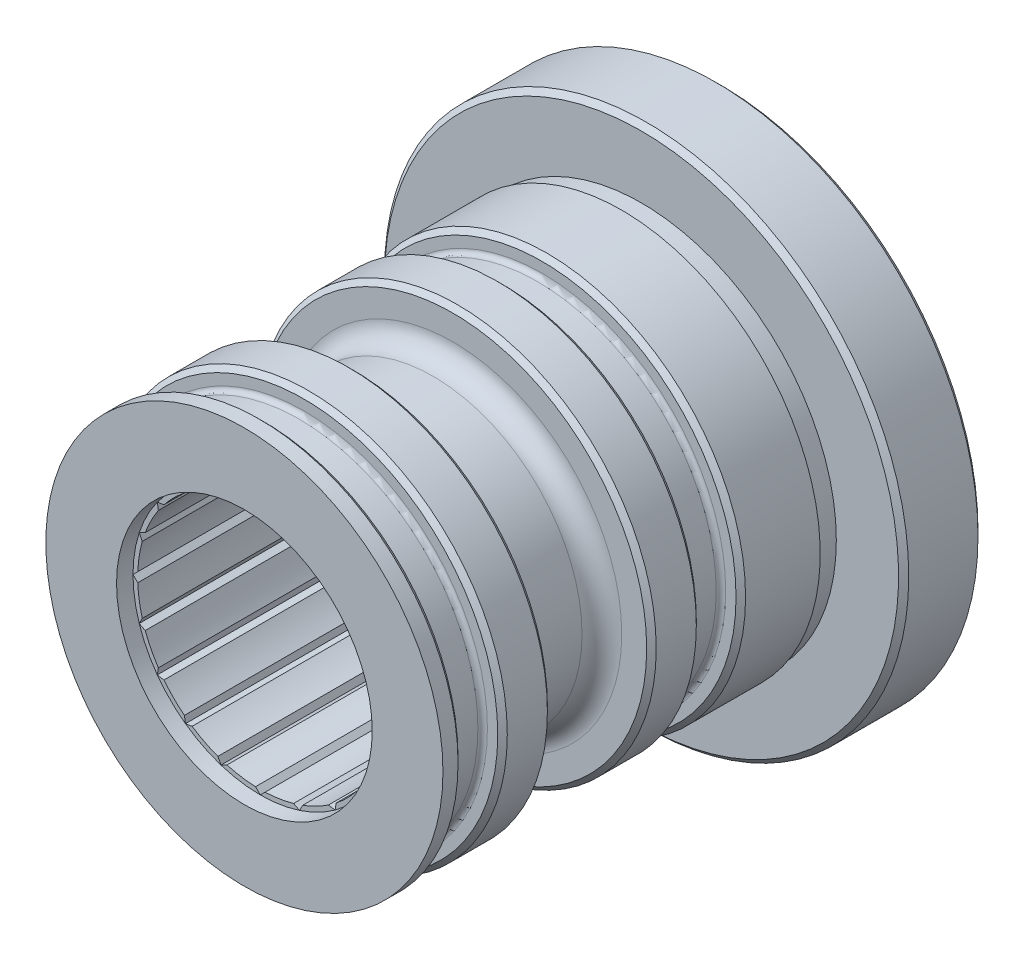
ISO-10303-21;
HEADER;
FILE_DESCRIPTION(('STEP AP214'),'2;1');
FILE_NAME('part.step','',(''),(''),'','','');
FILE_SCHEMA(('AUTOMOTIVE_DESIGN { 1 0 10303 214 1 1 1 1 }'));
ENDSEC;
DATA;
#1=APPLICATION_CONTEXT('core data for automotive mechanical design processes');
#2=APPLICATION_PROTOCOL_DEFINITION('international standard','automotive_design',2000,#1);
#3=PRODUCT_CONTEXT('',#1,'mechanical');
#4=PRODUCT('Part','Part','',(#3));
#5=PRODUCT_RELATED_PRODUCT_CATEGORY('part','',(#4));
#6=PRODUCT_DEFINITION_FORMATION('','',#4);
#7=PRODUCT_DEFINITION_CONTEXT('part definition',#1,'design');
#8=PRODUCT_DEFINITION('design','',#6,#7);
#9=PRODUCT_DEFINITION_SHAPE('','',#8);
#10=(LENGTH_UNIT() NAMED_UNIT(*) SI_UNIT(.MILLI.,.METRE.));
#11=(NAMED_UNIT(*) PLANE_ANGLE_UNIT() SI_UNIT($,.RADIAN.));
#12=(NAMED_UNIT(*) SI_UNIT($,.STERADIAN.) SOLID_ANGLE_UNIT());
#13=UNCERTAINTY_MEASURE_WITH_UNIT(LENGTH_MEASURE(1.E-05),#10,'distance_accuracy_value','');
#14=(GEOMETRIC_REPRESENTATION_CONTEXT(3) GLOBAL_UNCERTAINTY_ASSIGNED_CONTEXT((#13)) GLOBAL_UNIT_ASSIGNED_CONTEXT((#10,
#11,#12)) REPRESENTATION_CONTEXT('',''));
#15=CARTESIAN_POINT('',(0.,0.,0.));
#16=DIRECTION('',(0.,0.,1.));
#17=DIRECTION('',(1.,0.,0.));
#18=AXIS2_PLACEMENT_3D('',#15,#16,#17);
#19=CARTESIAN_POINT('',(0.,0.,76.2));
#20=DIRECTION('',(0.,0.,-1.));
#21=DIRECTION('',(-1.,0.,0.));
#22=AXIS2_PLACEMENT_3D('',#19,#20,#21);
#23=CYLINDRICAL_SURFACE('',#22,31.75);
#24=CARTESIAN_POINT('',(0.,0.,27.813));
#25=DIRECTION('',(0.,0.,1.));
#26=DIRECTION('',(1.,0.,0.));
#27=AXIS2_PLACEMENT_3D('',#24,#25,#26);
#28=CIRCLE('',#27,31.75);
#29=CARTESIAN_POINT('',(31.75,0.,27.813));
#30=VERTEX_POINT('',#29);
#31=EDGE_CURVE('E1400',#30,#30,#28,.T.);
#32=ORIENTED_EDGE('',*,*,#31,.F.);
#33=EDGE_LOOP('',(#32));
#34=FACE_BOUND('',#33,.T.);
#35=CARTESIAN_POINT('',(0.,0.,15.875));
#36=DIRECTION('',(0.,0.,-1.));
#37=DIRECTION('',(-1.,0.,0.));
#38=AXIS2_PLACEMENT_3D('',#35,#36,#37);
#39=CIRCLE('',#38,31.75);
#40=CARTESIAN_POINT('',(-31.75,0.,15.875));
#41=VERTEX_POINT('',#40);
#42=EDGE_CURVE('E38',#41,#41,#39,.T.);
#43=ORIENTED_EDGE('',*,*,#42,.F.);
#44=EDGE_LOOP('',(#43));
#45=FACE_BOUND('',#44,.T.);
#46=ADVANCED_FACE('F34',(#34,#45),#23,.T.);
#47=CARTESIAN_POINT('',(0.,0.,76.2));
#48=DIRECTION('',(0.,0.,1.));
#49=DIRECTION('',(1.,0.,0.));
#50=AXIS2_PLACEMENT_3D('',#47,#48,#49);
#51=CIRCLE('',#50,31.75);
#52=CARTESIAN_POINT('',(31.75,0.,76.2));
#53=VERTEX_POINT('',#52);
#54=EDGE_CURVE('E473',#53,#53,#51,.T.);
#55=ORIENTED_EDGE('',*,*,#54,.F.);
#56=EDGE_LOOP('',(#55));
#57=FACE_BOUND('',#56,.T.);
#58=CARTESIAN_POINT('',(0.,0.,73.787));
#59=DIRECTION('',(0.,0.,1.));
#60=DIRECTION('',(1.,0.,0.));
#61=AXIS2_PLACEMENT_3D('',#58,#59,#60);
#62=CIRCLE('',#61,31.75);
#63=CARTESIAN_POINT('',(31.75,0.,73.787));
#64=VERTEX_POINT('',#63);
#65=EDGE_CURVE('E1398',#64,#64,#62,.T.);
#66=ORIENTED_EDGE('',*,*,#65,.T.);
#67=EDGE_LOOP('',(#66));
#68=FACE_BOUND('',#67,.T.);
#69=ADVANCED_FACE('F515',(#57,#68),#23,.T.);
#70=CARTESIAN_POINT('',(0.,0.,45.72));
#71=DIRECTION('',(0.,0.,1.));
#72=DIRECTION('',(1.,0.,0.));
#73=AXIS2_PLACEMENT_3D('',#70,#71,#72);
#74=PLANE('',#73);
#75=CARTESIAN_POINT('',(0.,0.,45.72));
#76=DIRECTION('',(0.,0.,1.));
#77=DIRECTION('',(1.,0.,0.));
#78=AXIS2_PLACEMENT_3D('',#75,#76,#77);
#79=CIRCLE('',#78,19.6050826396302);
#80=CARTESIAN_POINT('',(18.8669234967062,5.32902083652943,45.72));
#81=VERTEX_POINT('',#80);
#82=CARTESIAN_POINT('',(18.3959815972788,6.77843096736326,45.72));
#83=VERTEX_POINT('',#82);
#84=EDGE_CURVE('E428',#81,#83,#79,.T.);
#85=ORIENTED_EDGE('',*,*,#84,.F.);
#86=DIRECTION('',(0.453990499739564,0.891006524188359,0.));
#87=VECTOR('',#86,1.);
#88=CARTESIAN_POINT('',(19.3561576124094,6.28919685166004,45.72));
#89=LINE('',#88,#87);
#90=CARTESIAN_POINT('',(19.3561576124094,6.28919685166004,45.72));
#91=VERTEX_POINT('',#90);
#92=EDGE_CURVE('E569',#81,#91,#89,.T.);
#93=ORIENTED_EDGE('',*,*,#92,.T.);
#94=DIRECTION('',(-0.891006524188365,0.453990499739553,0.));
#95=VECTOR('',#94,1.);
#96=CARTESIAN_POINT('',(19.3561576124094,6.28919685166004,45.72));
#97=LINE('',#96,#95);
#98=EDGE_CURVE('E572',#91,#83,#97,.T.);
#99=ORIENTED_EDGE('',*,*,#98,.T.);
#100=EDGE_LOOP('',(#85,#93,#99));
#101=FACE_BOUND('',#100,.T.);
#102=ADVANCED_FACE('F522',(#101),#74,.T.);
#103=CARTESIAN_POINT('',(16.2967525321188,10.8983999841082,45.72));
#104=VERTEX_POINT('',#103);
#105=CARTESIAN_POINT('',(15.4009678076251,12.1313418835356,45.72));
#106=VERTEX_POINT('',#105);
#107=EDGE_CURVE('E1207',#104,#106,#79,.T.);
#108=ORIENTED_EDGE('',*,*,#107,.F.);
#109=DIRECTION('',(0.15643446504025,0.987688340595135,0.));
#110=VECTOR('',#109,1.);
#111=CARTESIAN_POINT('',(16.4653311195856,11.9627632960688,45.72));
#112=LINE('',#111,#110);
#113=CARTESIAN_POINT('',(16.4653311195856,11.9627632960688,45.72));
#114=VERTEX_POINT('',#113);
#115=EDGE_CURVE('E587',#104,#114,#112,.T.);
#116=ORIENTED_EDGE('',*,*,#115,.T.);
#117=DIRECTION('',(-0.987688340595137,0.156434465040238,0.));
#118=VECTOR('',#117,1.);
#119=CARTESIAN_POINT('',(16.4653311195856,11.9627632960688,45.72));
#120=LINE('',#119,#118);
#121=EDGE_CURVE('E590',#114,#106,#120,.T.);
#122=ORIENTED_EDGE('',*,*,#121,.T.);
#123=EDGE_LOOP('',(#108,#116,#122));
#124=FACE_BOUND('',#123,.T.);
#125=ADVANCED_FACE('F1211',(#124),#74,.T.);
#126=CARTESIAN_POINT('',(12.131341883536,15.4009678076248,45.72));
#127=VERTEX_POINT('',#126);
#128=CARTESIAN_POINT('',(10.8983999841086,16.2967525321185,45.72));
#129=VERTEX_POINT('',#128);
#130=EDGE_CURVE('E1213',#127,#129,#79,.T.);
#131=ORIENTED_EDGE('',*,*,#130,.F.);
#132=DIRECTION('',(-0.156434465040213,0.987688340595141,0.));
#133=VECTOR('',#132,1.);
#134=CARTESIAN_POINT('',(11.9627632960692,16.4653311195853,45.72));
#135=LINE('',#134,#133);
#136=CARTESIAN_POINT('',(11.9627632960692,16.4653311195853,45.72));
#137=VERTEX_POINT('',#136);
#138=EDGE_CURVE('E605',#127,#137,#135,.T.);
#139=ORIENTED_EDGE('',*,*,#138,.T.);
#140=DIRECTION('',(-0.987688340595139,-0.156434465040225,0.));
#141=VECTOR('',#140,1.);
#142=CARTESIAN_POINT('',(11.9627632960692,16.4653311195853,45.72));
#143=LINE('',#142,#141);
#144=EDGE_CURVE('E608',#137,#129,#143,.T.);
#145=ORIENTED_EDGE('',*,*,#144,.T.);
#146=EDGE_LOOP('',(#131,#139,#145));
#147=FACE_BOUND('',#146,.T.);
#148=ADVANCED_FACE('F1364',(#147),#74,.T.);
#149=CARTESIAN_POINT('',(6.77843096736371,18.3959815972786,45.72));
#150=VERTEX_POINT('',#149);
#151=CARTESIAN_POINT('',(5.32902083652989,18.8669234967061,45.72));
#152=VERTEX_POINT('',#151);
#153=EDGE_CURVE('E1235',#150,#152,#79,.T.);
#154=ORIENTED_EDGE('',*,*,#153,.F.);
#155=DIRECTION('',(-0.453990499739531,0.891006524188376,0.));
#156=VECTOR('',#155,1.);
#157=CARTESIAN_POINT('',(6.28919685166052,19.3561576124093,45.72));
#158=LINE('',#157,#156);
#159=CARTESIAN_POINT('',(6.28919685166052,19.3561576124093,45.72));
#160=VERTEX_POINT('',#159);
#161=EDGE_CURVE('E623',#150,#160,#158,.T.);
#162=ORIENTED_EDGE('',*,*,#161,.T.);
#163=DIRECTION('',(-0.89100652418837,-0.453990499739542,0.));
#164=VECTOR('',#163,1.);
#165=CARTESIAN_POINT('',(6.28919685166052,19.3561576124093,45.72));
#166=LINE('',#165,#164);
#167=EDGE_CURVE('E626',#160,#152,#166,.T.);
#168=ORIENTED_EDGE('',*,*,#167,.T.);
#169=EDGE_LOOP('',(#154,#162,#168));
#170=FACE_BOUND('',#169,.T.);
#171=ADVANCED_FACE('F1234',(#170),#74,.T.);
#172=CARTESIAN_POINT('',(0.762000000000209,19.5902685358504,45.72));
#173=VERTEX_POINT('',#172);
#174=CARTESIAN_POINT('',(-0.761999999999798,19.5902685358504,45.72));
#175=VERTEX_POINT('',#174);
#176=EDGE_CURVE('E1362',#173,#175,#79,.T.);
#177=ORIENTED_EDGE('',*,*,#176,.F.);
#178=DIRECTION('',(-0.707106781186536,0.707106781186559,0.));
#179=VECTOR('',#178,1.);
#180=CARTESIAN_POINT('',(2.13178820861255E-13,20.3522685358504,45.72));
#181=LINE('',#180,#179);
#182=CARTESIAN_POINT('',(2.13178820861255E-13,20.3522685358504,45.72));
#183=VERTEX_POINT('',#182);
#184=EDGE_CURVE('E641',#173,#183,#181,.T.);
#185=ORIENTED_EDGE('',*,*,#184,.T.);
#186=DIRECTION('',(-0.707106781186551,-0.707106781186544,0.));
#187=VECTOR('',#186,1.);
#188=CARTESIAN_POINT('',(2.13178820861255E-13,20.3522685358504,45.72));
#189=LINE('',#188,#187);
#190=EDGE_CURVE('E644',#183,#175,#189,.T.);
#191=ORIENTED_EDGE('',*,*,#190,.T.);
#192=EDGE_LOOP('',(#177,#185,#191));
#193=FACE_BOUND('',#192,.T.);
#194=ADVANCED_FACE('F1371',(#193),#74,.T.);
#195=CARTESIAN_POINT('',(-5.32902083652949,18.8669234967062,45.72));
#196=VERTEX_POINT('',#195);
#197=CARTESIAN_POINT('',(-6.77843096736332,18.3959815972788,45.72));
#198=VERTEX_POINT('',#197);
#199=EDGE_CURVE('E1256',#196,#198,#79,.T.);
#200=ORIENTED_EDGE('',*,*,#199,.F.);
#201=DIRECTION('',(-0.891006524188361,0.453990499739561,0.));
#202=VECTOR('',#201,1.);
#203=CARTESIAN_POINT('',(-6.28919685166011,19.3561576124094,45.72));
#204=LINE('',#203,#202);
#205=CARTESIAN_POINT('',(-6.28919685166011,19.3561576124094,45.72));
#206=VERTEX_POINT('',#205);
#207=EDGE_CURVE('E659',#196,#206,#204,.T.);
#208=ORIENTED_EDGE('',*,*,#207,.T.);
#209=DIRECTION('',(-0.45399049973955,-0.891006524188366,0.));
#210=VECTOR('',#209,1.);
#211=CARTESIAN_POINT('',(-6.28919685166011,19.3561576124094,45.72));
#212=LINE('',#211,#210);
#213=EDGE_CURVE('E662',#206,#198,#212,.T.);
#214=ORIENTED_EDGE('',*,*,#213,.T.);
#215=EDGE_LOOP('',(#200,#208,#214));
#216=FACE_BOUND('',#215,.T.);
#217=ADVANCED_FACE('F1255',(#216),#74,.T.);
#218=CARTESIAN_POINT('',(-10.8983999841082,16.2967525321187,45.72));
#219=VERTEX_POINT('',#218);
#220=CARTESIAN_POINT('',(-12.1313418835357,15.400967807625,45.72));
#221=VERTEX_POINT('',#220);
#222=EDGE_CURVE('E1361',#219,#221,#79,.T.);
#223=ORIENTED_EDGE('',*,*,#222,.F.);
#224=DIRECTION('',(-0.987688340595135,0.156434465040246,0.));
#225=VECTOR('',#224,1.);
#226=CARTESIAN_POINT('',(-11.9627632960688,16.4653311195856,45.72));
#227=LINE('',#226,#225);
#228=CARTESIAN_POINT('',(-11.9627632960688,16.4653311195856,45.72));
#229=VERTEX_POINT('',#228);
#230=EDGE_CURVE('E677',#219,#229,#227,.T.);
#231=ORIENTED_EDGE('',*,*,#230,.T.);
#232=DIRECTION('',(-0.156434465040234,-0.987688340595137,0.));
#233=VECTOR('',#232,1.);
#234=CARTESIAN_POINT('',(-11.9627632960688,16.4653311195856,45.72));
#235=LINE('',#234,#233);
#236=EDGE_CURVE('E680',#229,#221,#235,.T.);
#237=ORIENTED_EDGE('',*,*,#236,.T.);
#238=EDGE_LOOP('',(#223,#231,#237));
#239=FACE_BOUND('',#238,.T.);
#240=ADVANCED_FACE('F2233',(#239),#74,.T.);
#241=CARTESIAN_POINT('',(-15.4009678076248,12.131341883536,45.72));
#242=VERTEX_POINT('',#241);
#243=CARTESIAN_POINT('',(-16.2967525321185,10.8983999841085,45.72));
#244=VERTEX_POINT('',#243);
#245=EDGE_CURVE('E1277',#242,#244,#79,.T.);
#246=ORIENTED_EDGE('',*,*,#245,.F.);
#247=DIRECTION('',(-0.98768834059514,-0.156434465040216,0.));
#248=VECTOR('',#247,1.);
#249=CARTESIAN_POINT('',(-16.4653311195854,11.9627632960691,45.72));
#250=LINE('',#249,#248);
#251=CARTESIAN_POINT('',(-16.4653311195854,11.9627632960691,45.72));
#252=VERTEX_POINT('',#251);
#253=EDGE_CURVE('E695',#242,#252,#250,.T.);
#254=ORIENTED_EDGE('',*,*,#253,.T.);
#255=DIRECTION('',(0.156434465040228,-0.987688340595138,0.));
#256=VECTOR('',#255,1.);
#257=CARTESIAN_POINT('',(-16.4653311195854,11.9627632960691,45.72));
#258=LINE('',#257,#256);
#259=EDGE_CURVE('E698',#252,#244,#258,.T.);
#260=ORIENTED_EDGE('',*,*,#259,.T.);
#261=EDGE_LOOP('',(#246,#254,#260));
#262=FACE_BOUND('',#261,.T.);
#263=ADVANCED_FACE('F1276',(#262),#74,.T.);
#264=CARTESIAN_POINT('',(-18.3959815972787,6.77843096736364,45.72));
#265=VERTEX_POINT('',#264);
#266=CARTESIAN_POINT('',(-18.8669234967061,5.32902083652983,45.72));
#267=VERTEX_POINT('',#266);
#268=EDGE_CURVE('E1360',#265,#267,#79,.T.);
#269=ORIENTED_EDGE('',*,*,#268,.F.);
#270=DIRECTION('',(-0.891006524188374,-0.453990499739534,0.));
#271=VECTOR('',#270,1.);
#272=CARTESIAN_POINT('',(-19.3561576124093,6.28919685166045,45.72));
#273=LINE('',#272,#271);
#274=CARTESIAN_POINT('',(-19.3561576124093,6.28919685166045,45.72));
#275=VERTEX_POINT('',#274);
#276=EDGE_CURVE('E713',#265,#275,#273,.T.);
#277=ORIENTED_EDGE('',*,*,#276,.T.);
#278=DIRECTION('',(0.453990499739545,-0.891006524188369,0.));
#279=VECTOR('',#278,1.);
#280=CARTESIAN_POINT('',(-19.3561576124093,6.28919685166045,45.72));
#281=LINE('',#280,#279);
#282=EDGE_CURVE('E716',#275,#267,#281,.T.);
#283=ORIENTED_EDGE('',*,*,#282,.T.);
#284=EDGE_LOOP('',(#269,#277,#283));
#285=FACE_BOUND('',#284,.T.);
#286=ADVANCED_FACE('F2221',(#285),#74,.T.);
#287=CARTESIAN_POINT('',(-19.5902685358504,0.762000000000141,45.72));
#288=VERTEX_POINT('',#287);
#289=CARTESIAN_POINT('',(-19.5902685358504,-0.761999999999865,45.72));
#290=VERTEX_POINT('',#289);
#291=EDGE_CURVE('E1298',#288,#290,#79,.T.);
#292=ORIENTED_EDGE('',*,*,#291,.F.);
#293=DIRECTION('',(-0.707106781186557,-0.707106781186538,0.));
#294=VECTOR('',#293,1.);
#295=CARTESIAN_POINT('',(-20.3522685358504,1.42119213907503E-13,45.72));
#296=LINE('',#295,#294);
#297=CARTESIAN_POINT('',(-20.3522685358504,1.42119213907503E-13,45.72));
#298=VERTEX_POINT('',#297);
#299=EDGE_CURVE('E731',#288,#298,#296,.T.);
#300=ORIENTED_EDGE('',*,*,#299,.T.);
#301=DIRECTION('',(0.707106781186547,-0.707106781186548,0.));
#302=VECTOR('',#301,1.);
#303=CARTESIAN_POINT('',(-20.3522685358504,1.42119213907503E-13,45.72));
#304=LINE('',#303,#302);
#305=EDGE_CURVE('E734',#298,#290,#304,.T.);
#306=ORIENTED_EDGE('',*,*,#305,.T.);
#307=EDGE_LOOP('',(#292,#300,#306));
#308=FACE_BOUND('',#307,.T.);
#309=ADVANCED_FACE('F1297',(#308),#74,.T.);
#310=CARTESIAN_POINT('',(-18.8669234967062,-5.32902083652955,45.72));
#311=VERTEX_POINT('',#310);
#312=CARTESIAN_POINT('',(-18.3959815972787,-6.77843096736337,45.72));
#313=VERTEX_POINT('',#312);
#314=EDGE_CURVE('E1359',#311,#313,#79,.T.);
#315=ORIENTED_EDGE('',*,*,#314,.F.);
#316=DIRECTION('',(-0.453990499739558,-0.891006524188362,0.));
#317=VECTOR('',#316,1.);
#318=CARTESIAN_POINT('',(-19.3561576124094,-6.28919685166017,45.72));
#319=LINE('',#318,#317);
#320=CARTESIAN_POINT('',(-19.3561576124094,-6.28919685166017,45.72));
#321=VERTEX_POINT('',#320);
#322=EDGE_CURVE('E749',#311,#321,#319,.T.);
#323=ORIENTED_EDGE('',*,*,#322,.T.);
#324=DIRECTION('',(0.891006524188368,-0.453990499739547,0.));
#325=VECTOR('',#324,1.);
#326=CARTESIAN_POINT('',(-19.3561576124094,-6.28919685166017,45.72));
#327=LINE('',#326,#325);
#328=EDGE_CURVE('E752',#321,#313,#327,.T.);
#329=ORIENTED_EDGE('',*,*,#328,.T.);
#330=EDGE_LOOP('',(#315,#323,#329));
#331=FACE_BOUND('',#330,.T.);
#332=ADVANCED_FACE('F2209',(#331),#74,.T.);
#333=CARTESIAN_POINT('',(-16.2967525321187,-10.8983999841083,45.72));
#334=VERTEX_POINT('',#333);
#335=CARTESIAN_POINT('',(-15.400967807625,-12.1313418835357,45.72));
#336=VERTEX_POINT('',#335);
#337=EDGE_CURVE('E1319',#334,#336,#79,.T.);
#338=ORIENTED_EDGE('',*,*,#337,.F.);
#339=DIRECTION('',(-0.156434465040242,-0.987688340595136,0.));
#340=VECTOR('',#339,1.);
#341=CARTESIAN_POINT('',(-16.4653311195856,-11.9627632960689,45.72));
#342=LINE('',#341,#340);
#343=CARTESIAN_POINT('',(-16.4653311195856,-11.9627632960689,45.72));
#344=VERTEX_POINT('',#343);
#345=EDGE_CURVE('E767',#334,#344,#342,.T.);
#346=ORIENTED_EDGE('',*,*,#345,.T.);
#347=DIRECTION('',(0.987688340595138,-0.156434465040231,0.));
#348=VECTOR('',#347,1.);
#349=CARTESIAN_POINT('',(-16.4653311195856,-11.9627632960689,45.72));
#350=LINE('',#349,#348);
#351=EDGE_CURVE('E770',#344,#336,#350,.T.);
#352=ORIENTED_EDGE('',*,*,#351,.T.);
#353=EDGE_LOOP('',(#338,#346,#352));
#354=FACE_BOUND('',#353,.T.);
#355=ADVANCED_FACE('F1318',(#354),#74,.T.);
#356=CARTESIAN_POINT('',(-12.1313418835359,-15.4009678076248,45.72));
#357=VERTEX_POINT('',#356);
#358=CARTESIAN_POINT('',(-10.8983999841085,-16.2967525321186,45.72));
#359=VERTEX_POINT('',#358);
#360=EDGE_CURVE('E1358',#357,#359,#79,.T.);
#361=ORIENTED_EDGE('',*,*,#360,.F.);
#362=DIRECTION('',(0.15643446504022,-0.987688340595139,0.));
#363=VECTOR('',#362,1.);
#364=CARTESIAN_POINT('',(-11.9627632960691,-16.4653311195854,45.72));
#365=LINE('',#364,#363);
#366=CARTESIAN_POINT('',(-11.9627632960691,-16.4653311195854,45.72));
#367=VERTEX_POINT('',#366);
#368=EDGE_CURVE('E785',#357,#367,#365,.T.);
#369=ORIENTED_EDGE('',*,*,#368,.T.);
#370=DIRECTION('',(0.987688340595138,0.156434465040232,0.));
#371=VECTOR('',#370,1.);
#372=CARTESIAN_POINT('',(-11.9627632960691,-16.4653311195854,45.72));
#373=LINE('',#372,#371);
#374=EDGE_CURVE('E788',#367,#359,#373,.T.);
#375=ORIENTED_EDGE('',*,*,#374,.T.);
#376=EDGE_LOOP('',(#361,#369,#375));
#377=FACE_BOUND('',#376,.T.);
#378=ADVANCED_FACE('F2197',(#377),#74,.T.);
#379=CARTESIAN_POINT('',(-6.77843096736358,-18.3959815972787,45.72));
#380=VERTEX_POINT('',#379);
#381=CARTESIAN_POINT('',(-5.32902083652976,-18.8669234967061,45.72));
#382=VERTEX_POINT('',#381);
#383=EDGE_CURVE('E1340',#380,#382,#79,.T.);
#384=ORIENTED_EDGE('',*,*,#383,.F.);
#385=DIRECTION('',(0.453990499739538,-0.891006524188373,0.));
#386=VECTOR('',#385,1.);
#387=CARTESIAN_POINT('',(-6.28919685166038,-19.3561576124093,45.72));
#388=LINE('',#387,#386);
#389=CARTESIAN_POINT('',(-6.28919685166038,-19.3561576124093,45.72));
#390=VERTEX_POINT('',#389);
#391=EDGE_CURVE('E803',#380,#390,#388,.T.);
#392=ORIENTED_EDGE('',*,*,#391,.T.);
#393=DIRECTION('',(0.891006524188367,0.453990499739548,0.));
#394=VECTOR('',#393,1.);
#395=CARTESIAN_POINT('',(-6.28919685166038,-19.3561576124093,45.72));
#396=LINE('',#395,#394);
#397=EDGE_CURVE('E806',#390,#382,#396,.T.);
#398=ORIENTED_EDGE('',*,*,#397,.T.);
#399=EDGE_LOOP('',(#384,#392,#398));
#400=FACE_BOUND('',#399,.T.);
#401=ADVANCED_FACE('F1339',(#400),#74,.T.);
#402=CARTESIAN_POINT('',(-0.76200000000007,-19.5902685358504,45.72));
#403=VERTEX_POINT('',#402);
#404=CARTESIAN_POINT('',(0.761999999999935,-19.5902685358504,45.72));
#405=VERTEX_POINT('',#404);
#406=EDGE_CURVE('E1154',#403,#405,#79,.T.);
#407=ORIENTED_EDGE('',*,*,#406,.F.);
#408=DIRECTION('',(0.707106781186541,-0.707106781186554,0.));
#409=VECTOR('',#408,1.);
#410=CARTESIAN_POINT('',(0.,-20.3522685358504,45.72));
#411=LINE('',#410,#409);
#412=CARTESIAN_POINT('',(0.,-20.3522685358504,45.72));
#413=VERTEX_POINT('',#412);
#414=EDGE_CURVE('E821',#403,#413,#411,.T.);
#415=ORIENTED_EDGE('',*,*,#414,.T.);
#416=DIRECTION('',(0.707106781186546,0.707106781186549,0.));
#417=VECTOR('',#416,1.);
#418=CARTESIAN_POINT('',(0.,-20.3522685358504,45.72));
#419=LINE('',#418,#417);
#420=EDGE_CURVE('E824',#413,#405,#419,.T.);
#421=ORIENTED_EDGE('',*,*,#420,.T.);
#422=EDGE_LOOP('',(#407,#415,#421));
#423=FACE_BOUND('',#422,.T.);
#424=ADVANCED_FACE('F1357',(#423),#74,.T.);
#425=CARTESIAN_POINT('',(5.32902083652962,-18.8669234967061,45.72));
#426=VERTEX_POINT('',#425);
#427=CARTESIAN_POINT('',(6.77843096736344,-18.3959815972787,45.72));
#428=VERTEX_POINT('',#427);
#429=EDGE_CURVE('E1152',#426,#428,#79,.T.);
#430=ORIENTED_EDGE('',*,*,#429,.F.);
#431=DIRECTION('',(0.891006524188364,-0.453990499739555,0.));
#432=VECTOR('',#431,1.);
#433=CARTESIAN_POINT('',(6.28919685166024,-19.3561576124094,45.72));
#434=LINE('',#433,#432);
#435=CARTESIAN_POINT('',(6.28919685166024,-19.3561576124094,45.72));
#436=VERTEX_POINT('',#435);
#437=EDGE_CURVE('E837',#426,#436,#434,.T.);
#438=ORIENTED_EDGE('',*,*,#437,.T.);
#439=DIRECTION('',(0.453990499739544,0.891006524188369,0.));
#440=VECTOR('',#439,1.);
#441=CARTESIAN_POINT('',(6.28919685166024,-19.3561576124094,45.72));
#442=LINE('',#441,#440);
#443=EDGE_CURVE('E840',#436,#428,#442,.T.);
#444=ORIENTED_EDGE('',*,*,#443,.T.);
#445=EDGE_LOOP('',(#430,#438,#444));
#446=FACE_BOUND('',#445,.T.);
#447=ADVANCED_FACE('F2180',(#446),#74,.T.);
#448=CARTESIAN_POINT('',(10.8983999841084,-16.2967525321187,45.72));
#449=VERTEX_POINT('',#448);
#450=CARTESIAN_POINT('',(12.1313418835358,-15.4009678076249,45.72));
#451=VERTEX_POINT('',#450);
#452=EDGE_CURVE('E1151',#449,#451,#79,.T.);
#453=ORIENTED_EDGE('',*,*,#452,.F.);
#454=DIRECTION('',(0.987688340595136,-0.156434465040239,0.));
#455=VECTOR('',#454,1.);
#456=CARTESIAN_POINT('',(11.9627632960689,-16.4653311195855,45.72));
#457=LINE('',#456,#455);
#458=CARTESIAN_POINT('',(11.9627632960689,-16.4653311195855,45.72));
#459=VERTEX_POINT('',#458);
#460=EDGE_CURVE('E855',#449,#459,#457,.T.);
#461=ORIENTED_EDGE('',*,*,#460,.T.);
#462=DIRECTION('',(0.156434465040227,0.987688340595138,0.));
#463=VECTOR('',#462,1.);
#464=CARTESIAN_POINT('',(11.9627632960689,-16.4653311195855,45.72));
#465=LINE('',#464,#463);
#466=EDGE_CURVE('E858',#459,#451,#465,.T.);
#467=ORIENTED_EDGE('',*,*,#466,.T.);
#468=EDGE_LOOP('',(#453,#461,#467));
#469=FACE_BOUND('',#468,.T.);
#470=ADVANCED_FACE('F1150',(#469),#74,.T.);
#471=CARTESIAN_POINT('',(15.4009678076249,-12.1313418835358,45.72));
#472=VERTEX_POINT('',#471);
#473=CARTESIAN_POINT('',(16.2967525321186,-10.8983999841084,45.72));
#474=VERTEX_POINT('',#473);
#475=EDGE_CURVE('E1153',#472,#474,#79,.T.);
#476=ORIENTED_EDGE('',*,*,#475,.F.);
#477=DIRECTION('',(0.987688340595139,0.156434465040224,0.));
#478=VECTOR('',#477,1.);
#479=CARTESIAN_POINT('',(16.4653311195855,-11.962763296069,45.72));
#480=LINE('',#479,#478);
#481=CARTESIAN_POINT('',(16.4653311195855,-11.962763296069,45.72));
#482=VERTEX_POINT('',#481);
#483=EDGE_CURVE('E871',#472,#482,#480,.T.);
#484=ORIENTED_EDGE('',*,*,#483,.T.);
#485=DIRECTION('',(-0.156434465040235,0.987688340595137,0.));
#486=VECTOR('',#485,1.);
#487=CARTESIAN_POINT('',(16.4653311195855,-11.962763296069,45.72));
#488=LINE('',#487,#486);
#489=EDGE_CURVE('E874',#482,#474,#488,.T.);
#490=ORIENTED_EDGE('',*,*,#489,.T.);
#491=EDGE_LOOP('',(#476,#484,#490));
#492=FACE_BOUND('',#491,.T.);
#493=ADVANCED_FACE('F2168',(#492),#74,.T.);
#494=CARTESIAN_POINT('',(18.3959815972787,-6.77843096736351,45.72));
#495=VERTEX_POINT('',#494);
#496=CARTESIAN_POINT('',(18.8669234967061,-5.32902083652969,45.72));
#497=VERTEX_POINT('',#496);
#498=EDGE_CURVE('E425',#495,#497,#79,.T.);
#499=ORIENTED_EDGE('',*,*,#498,.F.);
#500=DIRECTION('',(0.891006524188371,0.453990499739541,0.));
#501=VECTOR('',#500,1.);
#502=CARTESIAN_POINT('',(19.3561576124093,-6.28919685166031,45.72));
#503=LINE('',#502,#501);
#504=CARTESIAN_POINT('',(19.3561576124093,-6.28919685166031,45.72));
#505=VERTEX_POINT('',#504);
#506=EDGE_CURVE('E889',#495,#505,#503,.T.);
#507=ORIENTED_EDGE('',*,*,#506,.T.);
#508=DIRECTION('',(-0.453990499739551,0.891006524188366,0.));
#509=VECTOR('',#508,1.);
#510=CARTESIAN_POINT('',(19.3561576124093,-6.28919685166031,45.72));
#511=LINE('',#510,#509);
#512=EDGE_CURVE('E892',#505,#497,#511,.T.);
#513=ORIENTED_EDGE('',*,*,#512,.T.);
#514=EDGE_LOOP('',(#499,#507,#513));
#515=FACE_BOUND('',#514,.T.);
#516=ADVANCED_FACE('F1160',(#515),#74,.T.);
#517=CARTESIAN_POINT('',(0.,0.,73.66));
#518=DIRECTION('',(0.,0.,1.));
#519=DIRECTION('',(1.,0.,0.));
#520=AXIS2_PLACEMENT_3D('',#517,#518,#519);
#521=PLANE('',#520);
#522=DIRECTION('',(-0.453990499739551,0.891006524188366,0.));
#523=VECTOR('',#522,1.);
#524=CARTESIAN_POINT('',(19.3561576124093,-6.28919685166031,73.66));
#525=LINE('',#524,#523);
#526=CARTESIAN_POINT('',(19.3561576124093,-6.28919685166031,73.66));
#527=VERTEX_POINT('',#526);
#528=CARTESIAN_POINT('',(18.8669234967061,-5.32902083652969,73.66));
#529=VERTEX_POINT('',#528);
#530=EDGE_CURVE('E893',#527,#529,#525,.T.);
#531=ORIENTED_EDGE('',*,*,#530,.F.);
#532=CARTESIAN_POINT('',(0.,0.,73.66));
#533=DIRECTION('',(0.,0.,1.));
#534=DIRECTION('',(1.,0.,0.));
#535=AXIS2_PLACEMENT_3D('',#532,#533,#534);
#536=CIRCLE('',#535,20.3522685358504);
#537=CARTESIAN_POINT('',(20.3522685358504,0.,73.66));
#538=VERTEX_POINT('',#537);
#539=EDGE_CURVE('E469',#527,#538,#536,.T.);
#540=ORIENTED_EDGE('',*,*,#539,.T.);
#541=DIRECTION('',(0.707106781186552,0.707106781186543,0.));
#542=VECTOR('',#541,1.);
#543=CARTESIAN_POINT('',(20.3522685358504,0.,73.66));
#544=LINE('',#543,#542);
#545=CARTESIAN_POINT('',(19.5902685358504,-0.762,73.66));
#546=VERTEX_POINT('',#545);
#547=EDGE_CURVE('E460',#546,#538,#544,.T.);
#548=ORIENTED_EDGE('',*,*,#547,.F.);
#549=CARTESIAN_POINT('',(0.,0.,73.66));
#550=DIRECTION('',(0.,0.,1.));
#551=DIRECTION('',(1.,0.,0.));
#552=AXIS2_PLACEMENT_3D('',#549,#550,#551);
#553=CIRCLE('',#552,19.6050826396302);
#554=EDGE_CURVE('E462',#529,#546,#553,.T.);
#555=ORIENTED_EDGE('',*,*,#554,.F.);
#556=EDGE_LOOP('',(#531,#540,#548,#555));
#557=FACE_BOUND('',#556,.T.);
#558=ADVANCED_FACE('F935',(#557),#521,.T.);
#559=DIRECTION('',(0.987688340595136,-0.156434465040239,0.));
#560=VECTOR('',#559,1.);
#561=CARTESIAN_POINT('',(11.9627632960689,-16.4653311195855,73.66));
#562=LINE('',#561,#560);
#563=CARTESIAN_POINT('',(10.8983999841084,-16.2967525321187,73.66));
#564=VERTEX_POINT('',#563);
#565=CARTESIAN_POINT('',(11.9627632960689,-16.4653311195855,73.66));
#566=VERTEX_POINT('',#565);
#567=EDGE_CURVE('E851',#564,#566,#562,.T.);
#568=ORIENTED_EDGE('',*,*,#567,.F.);
#569=CARTESIAN_POINT('',(6.77843096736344,-18.3959815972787,73.66));
#570=VERTEX_POINT('',#569);
#571=EDGE_CURVE('E926',#570,#564,#553,.T.);
#572=ORIENTED_EDGE('',*,*,#571,.F.);
#573=DIRECTION('',(0.453990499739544,0.891006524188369,0.));
#574=VECTOR('',#573,1.);
#575=CARTESIAN_POINT('',(6.28919685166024,-19.3561576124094,73.66));
#576=LINE('',#575,#574);
#577=CARTESIAN_POINT('',(6.28919685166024,-19.3561576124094,73.66));
#578=VERTEX_POINT('',#577);
#579=EDGE_CURVE('E841',#578,#570,#576,.T.);
#580=ORIENTED_EDGE('',*,*,#579,.F.);
#581=EDGE_CURVE('E941',#578,#566,#536,.T.);
#582=ORIENTED_EDGE('',*,*,#581,.T.);
#583=EDGE_LOOP('',(#568,#572,#580,#582));
#584=FACE_BOUND('',#583,.T.);
#585=ADVANCED_FACE('F1135',(#584),#521,.T.);
#586=DIRECTION('',(0.707106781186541,-0.707106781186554,0.));
#587=VECTOR('',#586,1.);
#588=CARTESIAN_POINT('',(0.,-20.3522685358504,73.66));
#589=LINE('',#588,#587);
#590=CARTESIAN_POINT('',(-0.762000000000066,-19.5902685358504,73.66));
#591=VERTEX_POINT('',#590);
#592=CARTESIAN_POINT('',(0.,-20.3522685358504,73.66));
#593=VERTEX_POINT('',#592);
#594=EDGE_CURVE('E817',#591,#593,#589,.T.);
#595=ORIENTED_EDGE('',*,*,#594,.F.);
#596=CARTESIAN_POINT('',(-5.32902083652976,-18.8669234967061,73.66));
#597=VERTEX_POINT('',#596);
#598=EDGE_CURVE('E1115',#597,#591,#553,.T.);
#599=ORIENTED_EDGE('',*,*,#598,.F.);
#600=DIRECTION('',(0.891006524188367,0.453990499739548,0.));
#601=VECTOR('',#600,1.);
#602=CARTESIAN_POINT('',(-6.28919685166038,-19.3561576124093,73.66));
#603=LINE('',#602,#601);
#604=CARTESIAN_POINT('',(-6.28919685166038,-19.3561576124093,73.66));
#605=VERTEX_POINT('',#604);
#606=EDGE_CURVE('E807',#605,#597,#603,.T.);
#607=ORIENTED_EDGE('',*,*,#606,.F.);
#608=EDGE_CURVE('E952',#605,#593,#536,.T.);
#609=ORIENTED_EDGE('',*,*,#608,.T.);
#610=EDGE_LOOP('',(#595,#599,#607,#609));
#611=FACE_BOUND('',#610,.T.);
#612=ADVANCED_FACE('F1345',(#611),#521,.T.);
#613=DIRECTION('',(0.15643446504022,-0.987688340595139,0.));
#614=VECTOR('',#613,1.);
#615=CARTESIAN_POINT('',(-11.9627632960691,-16.4653311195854,73.66));
#616=LINE('',#615,#614);
#617=CARTESIAN_POINT('',(-12.1313418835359,-15.4009678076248,73.66));
#618=VERTEX_POINT('',#617);
#619=CARTESIAN_POINT('',(-11.9627632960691,-16.4653311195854,73.66));
#620=VERTEX_POINT('',#619);
#621=EDGE_CURVE('E781',#618,#620,#616,.T.);
#622=ORIENTED_EDGE('',*,*,#621,.F.);
#623=CARTESIAN_POINT('',(-15.400967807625,-12.1313418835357,73.66));
#624=VERTEX_POINT('',#623);
#625=EDGE_CURVE('E1105',#624,#618,#553,.T.);
#626=ORIENTED_EDGE('',*,*,#625,.F.);
#627=DIRECTION('',(0.987688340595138,-0.156434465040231,0.));
#628=VECTOR('',#627,1.);
#629=CARTESIAN_POINT('',(-16.4653311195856,-11.9627632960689,73.66));
#630=LINE('',#629,#628);
#631=CARTESIAN_POINT('',(-16.4653311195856,-11.9627632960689,73.66));
#632=VERTEX_POINT('',#631);
#633=EDGE_CURVE('E771',#632,#624,#630,.T.);
#634=ORIENTED_EDGE('',*,*,#633,.F.);
#635=EDGE_CURVE('E963',#632,#620,#536,.T.);
#636=ORIENTED_EDGE('',*,*,#635,.T.);
#637=EDGE_LOOP('',(#622,#626,#634,#636));
#638=FACE_BOUND('',#637,.T.);
#639=ADVANCED_FACE('F1324',(#638),#521,.T.);
#640=DIRECTION('',(-0.453990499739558,-0.891006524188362,0.));
#641=VECTOR('',#640,1.);
#642=CARTESIAN_POINT('',(-19.3561576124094,-6.28919685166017,73.66));
#643=LINE('',#642,#641);
#644=CARTESIAN_POINT('',(-18.8669234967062,-5.32902083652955,73.66));
#645=VERTEX_POINT('',#644);
#646=CARTESIAN_POINT('',(-19.3561576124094,-6.28919685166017,73.66));
#647=VERTEX_POINT('',#646);
#648=EDGE_CURVE('E745',#645,#647,#643,.T.);
#649=ORIENTED_EDGE('',*,*,#648,.F.);
#650=CARTESIAN_POINT('',(-19.5902685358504,-0.761999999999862,73.66));
#651=VERTEX_POINT('',#650);
#652=EDGE_CURVE('E1095',#651,#645,#553,.T.);
#653=ORIENTED_EDGE('',*,*,#652,.F.);
#654=DIRECTION('',(0.707106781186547,-0.707106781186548,0.));
#655=VECTOR('',#654,1.);
#656=CARTESIAN_POINT('',(-20.3522685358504,1.42119213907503E-13,73.66));
#657=LINE('',#656,#655);
#658=CARTESIAN_POINT('',(-20.3522685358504,1.42119213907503E-13,73.66));
#659=VERTEX_POINT('',#658);
#660=EDGE_CURVE('E735',#659,#651,#657,.T.);
#661=ORIENTED_EDGE('',*,*,#660,.F.);
#662=EDGE_CURVE('E975',#659,#647,#536,.T.);
#663=ORIENTED_EDGE('',*,*,#662,.T.);
#664=EDGE_LOOP('',(#649,#653,#661,#663));
#665=FACE_BOUND('',#664,.T.);
#666=ADVANCED_FACE('F1303',(#665),#521,.T.);
#667=DIRECTION('',(-0.891006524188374,-0.453990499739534,0.));
#668=VECTOR('',#667,1.);
#669=CARTESIAN_POINT('',(-19.3561576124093,6.28919685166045,73.66));
#670=LINE('',#669,#668);
#671=CARTESIAN_POINT('',(-18.3959815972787,6.77843096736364,73.66));
#672=VERTEX_POINT('',#671);
#673=CARTESIAN_POINT('',(-19.3561576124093,6.28919685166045,73.66));
#674=VERTEX_POINT('',#673);
#675=EDGE_CURVE('E709',#672,#674,#670,.T.);
#676=ORIENTED_EDGE('',*,*,#675,.F.);
#677=CARTESIAN_POINT('',(-16.2967525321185,10.8983999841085,73.66));
#678=VERTEX_POINT('',#677);
#679=EDGE_CURVE('E1085',#678,#672,#553,.T.);
#680=ORIENTED_EDGE('',*,*,#679,.F.);
#681=DIRECTION('',(0.156434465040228,-0.987688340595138,0.));
#682=VECTOR('',#681,1.);
#683=CARTESIAN_POINT('',(-16.4653311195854,11.9627632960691,73.66));
#684=LINE('',#683,#682);
#685=CARTESIAN_POINT('',(-16.4653311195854,11.9627632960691,73.66));
#686=VERTEX_POINT('',#685);
#687=EDGE_CURVE('E699',#686,#678,#684,.T.);
#688=ORIENTED_EDGE('',*,*,#687,.F.);
#689=EDGE_CURVE('E987',#686,#674,#536,.T.);
#690=ORIENTED_EDGE('',*,*,#689,.T.);
#691=EDGE_LOOP('',(#676,#680,#688,#690));
#692=FACE_BOUND('',#691,.T.);
#693=ADVANCED_FACE('F1282',(#692),#521,.T.);
#694=DIRECTION('',(-0.987688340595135,0.156434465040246,0.));
#695=VECTOR('',#694,1.);
#696=CARTESIAN_POINT('',(-11.9627632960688,16.4653311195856,73.66));
#697=LINE('',#696,#695);
#698=CARTESIAN_POINT('',(-10.8983999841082,16.2967525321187,73.66));
#699=VERTEX_POINT('',#698);
#700=CARTESIAN_POINT('',(-11.9627632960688,16.4653311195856,73.66));
#701=VERTEX_POINT('',#700);
#702=EDGE_CURVE('E673',#699,#701,#697,.T.);
#703=ORIENTED_EDGE('',*,*,#702,.F.);
#704=CARTESIAN_POINT('',(-6.77843096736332,18.3959815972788,73.66));
#705=VERTEX_POINT('',#704);
#706=EDGE_CURVE('E1075',#705,#699,#553,.T.);
#707=ORIENTED_EDGE('',*,*,#706,.F.);
#708=DIRECTION('',(-0.45399049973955,-0.891006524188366,0.));
#709=VECTOR('',#708,1.);
#710=CARTESIAN_POINT('',(-6.28919685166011,19.3561576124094,73.66));
#711=LINE('',#710,#709);
#712=CARTESIAN_POINT('',(-6.28919685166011,19.3561576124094,73.66));
#713=VERTEX_POINT('',#712);
#714=EDGE_CURVE('E663',#713,#705,#711,.T.);
#715=ORIENTED_EDGE('',*,*,#714,.F.);
#716=EDGE_CURVE('E999',#713,#701,#536,.T.);
#717=ORIENTED_EDGE('',*,*,#716,.T.);
#718=EDGE_LOOP('',(#703,#707,#715,#717));
#719=FACE_BOUND('',#718,.T.);
#720=ADVANCED_FACE('F1261',(#719),#521,.T.);
#721=DIRECTION('',(-0.707106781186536,0.707106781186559,0.));
#722=VECTOR('',#721,1.);
#723=CARTESIAN_POINT('',(2.13178820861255E-13,20.3522685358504,73.66));
#724=LINE('',#723,#722);
#725=CARTESIAN_POINT('',(0.762000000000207,19.5902685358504,73.66));
#726=VERTEX_POINT('',#725);
#727=CARTESIAN_POINT('',(2.13178820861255E-13,20.3522685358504,73.66));
#728=VERTEX_POINT('',#727);
#729=EDGE_CURVE('E637',#726,#728,#724,.T.);
#730=ORIENTED_EDGE('',*,*,#729,.F.);
#731=CARTESIAN_POINT('',(5.32902083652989,18.8669234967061,73.66));
#732=VERTEX_POINT('',#731);
#733=EDGE_CURVE('E1065',#732,#726,#553,.T.);
#734=ORIENTED_EDGE('',*,*,#733,.F.);
#735=DIRECTION('',(-0.89100652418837,-0.453990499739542,0.));
#736=VECTOR('',#735,1.);
#737=CARTESIAN_POINT('',(6.28919685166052,19.3561576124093,73.66));
#738=LINE('',#737,#736);
#739=CARTESIAN_POINT('',(6.28919685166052,19.3561576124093,73.66));
#740=VERTEX_POINT('',#739);
#741=EDGE_CURVE('E627',#740,#732,#738,.T.);
#742=ORIENTED_EDGE('',*,*,#741,.F.);
#743=EDGE_CURVE('E1011',#740,#728,#536,.T.);
#744=ORIENTED_EDGE('',*,*,#743,.T.);
#745=EDGE_LOOP('',(#730,#734,#742,#744));
#746=FACE_BOUND('',#745,.T.);
#747=ADVANCED_FACE('F1240',(#746),#521,.T.);
#748=DIRECTION('',(-0.156434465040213,0.987688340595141,0.));
#749=VECTOR('',#748,1.);
#750=CARTESIAN_POINT('',(11.9627632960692,16.4653311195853,73.66));
#751=LINE('',#750,#749);
#752=CARTESIAN_POINT('',(12.131341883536,15.4009678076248,73.66));
#753=VERTEX_POINT('',#752);
#754=CARTESIAN_POINT('',(11.9627632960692,16.4653311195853,73.66));
#755=VERTEX_POINT('',#754);
#756=EDGE_CURVE('E601',#753,#755,#751,.T.);
#757=ORIENTED_EDGE('',*,*,#756,.F.);
#758=CARTESIAN_POINT('',(15.4009678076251,12.1313418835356,73.66));
#759=VERTEX_POINT('',#758);
#760=EDGE_CURVE('E1058',#759,#753,#553,.T.);
#761=ORIENTED_EDGE('',*,*,#760,.F.);
#762=DIRECTION('',(-0.987688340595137,0.156434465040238,0.));
#763=VECTOR('',#762,1.);
#764=CARTESIAN_POINT('',(16.4653311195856,11.9627632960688,73.66));
#765=LINE('',#764,#763);
#766=CARTESIAN_POINT('',(16.4653311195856,11.9627632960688,73.66));
#767=VERTEX_POINT('',#766);
#768=EDGE_CURVE('E591',#767,#759,#765,.T.);
#769=ORIENTED_EDGE('',*,*,#768,.F.);
#770=EDGE_CURVE('E1023',#767,#755,#536,.T.);
#771=ORIENTED_EDGE('',*,*,#770,.T.);
#772=EDGE_LOOP('',(#757,#761,#769,#771));
#773=FACE_BOUND('',#772,.T.);
#774=ADVANCED_FACE('F1219',(#773),#521,.T.);
#775=DIRECTION('',(0.453990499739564,0.891006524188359,0.));
#776=VECTOR('',#775,1.);
#777=CARTESIAN_POINT('',(19.3561576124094,6.28919685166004,73.66));
#778=LINE('',#777,#776);
#779=CARTESIAN_POINT('',(18.8669234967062,5.32902083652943,73.66));
#780=VERTEX_POINT('',#779);
#781=CARTESIAN_POINT('',(19.3561576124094,6.28919685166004,73.66));
#782=VERTEX_POINT('',#781);
#783=EDGE_CURVE('E576',#780,#782,#778,.T.);
#784=ORIENTED_EDGE('',*,*,#783,.F.);
#785=CARTESIAN_POINT('',(19.5902685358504,0.762,73.66));
#786=VERTEX_POINT('',#785);
#787=EDGE_CURVE('E458',#786,#780,#553,.T.);
#788=ORIENTED_EDGE('',*,*,#787,.F.);
#789=DIRECTION('',(-0.707106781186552,0.707106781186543,0.));
#790=VECTOR('',#789,1.);
#791=CARTESIAN_POINT('',(20.3522685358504,0.,73.66));
#792=LINE('',#791,#790);
#793=EDGE_CURVE('E437',#538,#786,#792,.T.);
#794=ORIENTED_EDGE('',*,*,#793,.F.);
#795=EDGE_CURVE('E470',#538,#782,#536,.T.);
#796=ORIENTED_EDGE('',*,*,#795,.T.);
#797=EDGE_LOOP('',(#784,#788,#794,#796));
#798=FACE_BOUND('',#797,.T.);
#799=ADVANCED_FACE('F1045',(#798),#521,.T.);
#800=DIRECTION('',(-0.987688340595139,-0.156434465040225,0.));
#801=VECTOR('',#800,1.);
#802=CARTESIAN_POINT('',(11.9627632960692,16.4653311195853,73.66));
#803=LINE('',#802,#801);
#804=CARTESIAN_POINT('',(10.8983999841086,16.2967525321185,73.66));
#805=VERTEX_POINT('',#804);
#806=EDGE_CURVE('E609',#755,#805,#803,.T.);
#807=ORIENTED_EDGE('',*,*,#806,.F.);
#808=EDGE_CURVE('E1017',#755,#740,#536,.T.);
#809=ORIENTED_EDGE('',*,*,#808,.T.);
#810=DIRECTION('',(-0.453990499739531,0.891006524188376,0.));
#811=VECTOR('',#810,1.);
#812=CARTESIAN_POINT('',(6.28919685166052,19.3561576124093,73.66));
#813=LINE('',#812,#811);
#814=CARTESIAN_POINT('',(6.7784309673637,18.3959815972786,73.66));
#815=VERTEX_POINT('',#814);
#816=EDGE_CURVE('E619',#815,#740,#813,.T.);
#817=ORIENTED_EDGE('',*,*,#816,.F.);
#818=EDGE_CURVE('E1060',#805,#815,#553,.T.);
#819=ORIENTED_EDGE('',*,*,#818,.F.);
#820=EDGE_LOOP('',(#807,#809,#817,#819));
#821=FACE_BOUND('',#820,.T.);
#822=ADVANCED_FACE('F1223',(#821),#521,.T.);
#823=DIRECTION('',(-0.707106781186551,-0.707106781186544,0.));
#824=VECTOR('',#823,1.);
#825=CARTESIAN_POINT('',(2.13178820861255E-13,20.3522685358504,73.66));
#826=LINE('',#825,#824);
#827=CARTESIAN_POINT('',(-0.761999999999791,19.5902685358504,73.66));
#828=VERTEX_POINT('',#827);
#829=EDGE_CURVE('E645',#728,#828,#826,.T.);
#830=ORIENTED_EDGE('',*,*,#829,.F.);
#831=EDGE_CURVE('E1005',#728,#713,#536,.T.);
#832=ORIENTED_EDGE('',*,*,#831,.T.);
#833=DIRECTION('',(-0.891006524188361,0.453990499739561,0.));
#834=VECTOR('',#833,1.);
#835=CARTESIAN_POINT('',(-6.28919685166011,19.3561576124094,73.66));
#836=LINE('',#835,#834);
#837=CARTESIAN_POINT('',(-5.3290208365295,18.8669234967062,73.66));
#838=VERTEX_POINT('',#837);
#839=EDGE_CURVE('E655',#838,#713,#836,.T.);
#840=ORIENTED_EDGE('',*,*,#839,.F.);
#841=EDGE_CURVE('E1070',#828,#838,#553,.T.);
#842=ORIENTED_EDGE('',*,*,#841,.F.);
#843=EDGE_LOOP('',(#830,#832,#840,#842));
#844=FACE_BOUND('',#843,.T.);
#845=ADVANCED_FACE('F1244',(#844),#521,.T.);
#846=DIRECTION('',(-0.156434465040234,-0.987688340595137,0.));
#847=VECTOR('',#846,1.);
#848=CARTESIAN_POINT('',(-11.9627632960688,16.4653311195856,73.66));
#849=LINE('',#848,#847);
#850=CARTESIAN_POINT('',(-12.1313418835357,15.400967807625,73.66));
#851=VERTEX_POINT('',#850);
#852=EDGE_CURVE('E681',#701,#851,#849,.T.);
#853=ORIENTED_EDGE('',*,*,#852,.F.);
#854=EDGE_CURVE('E993',#701,#686,#536,.T.);
#855=ORIENTED_EDGE('',*,*,#854,.T.);
#856=DIRECTION('',(-0.98768834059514,-0.156434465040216,0.));
#857=VECTOR('',#856,1.);
#858=CARTESIAN_POINT('',(-16.4653311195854,11.9627632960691,73.66));
#859=LINE('',#858,#857);
#860=CARTESIAN_POINT('',(-15.4009678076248,12.131341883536,73.66));
#861=VERTEX_POINT('',#860);
#862=EDGE_CURVE('E691',#861,#686,#859,.T.);
#863=ORIENTED_EDGE('',*,*,#862,.F.);
#864=EDGE_CURVE('E1080',#851,#861,#553,.T.);
#865=ORIENTED_EDGE('',*,*,#864,.F.);
#866=EDGE_LOOP('',(#853,#855,#863,#865));
#867=FACE_BOUND('',#866,.T.);
#868=ADVANCED_FACE('F1265',(#867),#521,.T.);
#869=DIRECTION('',(0.453990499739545,-0.891006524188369,0.));
#870=VECTOR('',#869,1.);
#871=CARTESIAN_POINT('',(-19.3561576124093,6.28919685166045,73.66));
#872=LINE('',#871,#870);
#873=CARTESIAN_POINT('',(-18.8669234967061,5.32902083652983,73.66));
#874=VERTEX_POINT('',#873);
#875=EDGE_CURVE('E717',#674,#874,#872,.T.);
#876=ORIENTED_EDGE('',*,*,#875,.F.);
#877=EDGE_CURVE('E981',#674,#659,#536,.T.);
#878=ORIENTED_EDGE('',*,*,#877,.T.);
#879=DIRECTION('',(-0.707106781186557,-0.707106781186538,0.));
#880=VECTOR('',#879,1.);
#881=CARTESIAN_POINT('',(-20.3522685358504,1.42119213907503E-13,73.66));
#882=LINE('',#881,#880);
#883=CARTESIAN_POINT('',(-19.5902685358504,0.762000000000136,73.66));
#884=VERTEX_POINT('',#883);
#885=EDGE_CURVE('E727',#884,#659,#882,.T.);
#886=ORIENTED_EDGE('',*,*,#885,.F.);
#887=EDGE_CURVE('E1090',#874,#884,#553,.T.);
#888=ORIENTED_EDGE('',*,*,#887,.F.);
#889=EDGE_LOOP('',(#876,#878,#886,#888));
#890=FACE_BOUND('',#889,.T.);
#891=ADVANCED_FACE('F1286',(#890),#521,.T.);
#892=DIRECTION('',(0.891006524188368,-0.453990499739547,0.));
#893=VECTOR('',#892,1.);
#894=CARTESIAN_POINT('',(-19.3561576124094,-6.28919685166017,73.66));
#895=LINE('',#894,#893);
#896=CARTESIAN_POINT('',(-18.3959815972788,-6.77843096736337,73.66));
#897=VERTEX_POINT('',#896);
#898=EDGE_CURVE('E753',#647,#897,#895,.T.);
#899=ORIENTED_EDGE('',*,*,#898,.F.);
#900=EDGE_CURVE('E969',#647,#632,#536,.T.);
#901=ORIENTED_EDGE('',*,*,#900,.T.);
#902=DIRECTION('',(-0.156434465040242,-0.987688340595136,0.));
#903=VECTOR('',#902,1.);
#904=CARTESIAN_POINT('',(-16.4653311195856,-11.9627632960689,73.66));
#905=LINE('',#904,#903);
#906=CARTESIAN_POINT('',(-16.2967525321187,-10.8983999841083,73.66));
#907=VERTEX_POINT('',#906);
#908=EDGE_CURVE('E763',#907,#632,#905,.T.);
#909=ORIENTED_EDGE('',*,*,#908,.F.);
#910=EDGE_CURVE('E1100',#897,#907,#553,.T.);
#911=ORIENTED_EDGE('',*,*,#910,.F.);
#912=EDGE_LOOP('',(#899,#901,#909,#911));
#913=FACE_BOUND('',#912,.T.);
#914=ADVANCED_FACE('F1307',(#913),#521,.T.);
#915=DIRECTION('',(0.987688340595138,0.156434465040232,0.));
#916=VECTOR('',#915,1.);
#917=CARTESIAN_POINT('',(-11.9627632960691,-16.4653311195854,73.66));
#918=LINE('',#917,#916);
#919=CARTESIAN_POINT('',(-10.8983999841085,-16.2967525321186,73.66));
#920=VERTEX_POINT('',#919);
#921=EDGE_CURVE('E789',#620,#920,#918,.T.);
#922=ORIENTED_EDGE('',*,*,#921,.F.);
#923=EDGE_CURVE('E957',#620,#605,#536,.T.);
#924=ORIENTED_EDGE('',*,*,#923,.T.);
#925=DIRECTION('',(0.453990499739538,-0.891006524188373,0.));
#926=VECTOR('',#925,1.);
#927=CARTESIAN_POINT('',(-6.28919685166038,-19.3561576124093,73.66));
#928=LINE('',#927,#926);
#929=CARTESIAN_POINT('',(-6.77843096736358,-18.3959815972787,73.66));
#930=VERTEX_POINT('',#929);
#931=EDGE_CURVE('E799',#930,#605,#928,.T.);
#932=ORIENTED_EDGE('',*,*,#931,.F.);
#933=EDGE_CURVE('E1110',#920,#930,#553,.T.);
#934=ORIENTED_EDGE('',*,*,#933,.F.);
#935=EDGE_LOOP('',(#922,#924,#932,#934));
#936=FACE_BOUND('',#935,.T.);
#937=ADVANCED_FACE('F1328',(#936),#521,.T.);
#938=DIRECTION('',(0.707106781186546,0.707106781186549,0.));
#939=VECTOR('',#938,1.);
#940=CARTESIAN_POINT('',(0.,-20.3522685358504,73.66));
#941=LINE('',#940,#939);
#942=CARTESIAN_POINT('',(0.761999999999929,-19.5902685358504,73.66));
#943=VERTEX_POINT('',#942);
#944=EDGE_CURVE('E58',#593,#943,#941,.T.);
#945=ORIENTED_EDGE('',*,*,#944,.F.);
#946=EDGE_CURVE('E946',#593,#578,#536,.T.);
#947=ORIENTED_EDGE('',*,*,#946,.T.);
#948=DIRECTION('',(0.891006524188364,-0.453990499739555,0.));
#949=VECTOR('',#948,1.);
#950=CARTESIAN_POINT('',(6.28919685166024,-19.3561576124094,73.66));
#951=LINE('',#950,#949);
#952=CARTESIAN_POINT('',(5.32902083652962,-18.8669234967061,73.66));
#953=VERTEX_POINT('',#952);
#954=EDGE_CURVE('E833',#953,#578,#951,.T.);
#955=ORIENTED_EDGE('',*,*,#954,.F.);
#956=EDGE_CURVE('E1120',#943,#953,#553,.T.);
#957=ORIENTED_EDGE('',*,*,#956,.F.);
#958=EDGE_LOOP('',(#945,#947,#955,#957));
#959=FACE_BOUND('',#958,.T.);
#960=ADVANCED_FACE('F1349',(#959),#521,.T.);
#961=DIRECTION('',(0.156434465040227,0.987688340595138,0.));
#962=VECTOR('',#961,1.);
#963=CARTESIAN_POINT('',(11.9627632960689,-16.4653311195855,73.66));
#964=LINE('',#963,#962);
#965=CARTESIAN_POINT('',(12.1313418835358,-15.4009678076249,73.66));
#966=VERTEX_POINT('',#965);
#967=EDGE_CURVE('E50',#566,#966,#964,.T.);
#968=ORIENTED_EDGE('',*,*,#967,.F.);
#969=CARTESIAN_POINT('',(16.4653311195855,-11.962763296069,73.66));
#970=VERTEX_POINT('',#969);
#971=EDGE_CURVE('E939',#566,#970,#536,.T.);
#972=ORIENTED_EDGE('',*,*,#971,.T.);
#973=DIRECTION('',(0.987688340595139,0.156434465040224,0.));
#974=VECTOR('',#973,1.);
#975=CARTESIAN_POINT('',(16.4653311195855,-11.962763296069,73.66));
#976=LINE('',#975,#974);
#977=CARTESIAN_POINT('',(15.4009678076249,-12.1313418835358,73.66));
#978=VERTEX_POINT('',#977);
#979=EDGE_CURVE('E867',#978,#970,#976,.T.);
#980=ORIENTED_EDGE('',*,*,#979,.F.);
#981=EDGE_CURVE('E924',#966,#978,#553,.T.);
#982=ORIENTED_EDGE('',*,*,#981,.F.);
#983=EDGE_LOOP('',(#968,#972,#980,#982));
#984=FACE_BOUND('',#983,.T.);
#985=ADVANCED_FACE('F1140',(#984),#521,.T.);
#986=DIRECTION('',(0.891006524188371,0.453990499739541,0.));
#987=VECTOR('',#986,1.);
#988=CARTESIAN_POINT('',(19.3561576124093,-6.28919685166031,73.66));
#989=LINE('',#988,#987);
#990=CARTESIAN_POINT('',(18.3959815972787,-6.77843096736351,73.66));
#991=VERTEX_POINT('',#990);
#992=EDGE_CURVE('E885',#991,#527,#989,.T.);
#993=ORIENTED_EDGE('',*,*,#992,.F.);
#994=CARTESIAN_POINT('',(16.2967525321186,-10.8983999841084,73.66));
#995=VERTEX_POINT('',#994);
#996=EDGE_CURVE('E919',#995,#991,#553,.T.);
#997=ORIENTED_EDGE('',*,*,#996,.F.);
#998=DIRECTION('',(-0.156434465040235,0.987688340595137,0.));
#999=VECTOR('',#998,1.);
#1000=CARTESIAN_POINT('',(16.4653311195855,-11.962763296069,73.66));
#1001=LINE('',#1000,#999);
#1002=EDGE_CURVE('E875',#970,#995,#1001,.T.);
#1003=ORIENTED_EDGE('',*,*,#1002,.F.);
#1004=EDGE_CURVE('E921',#970,#527,#536,.T.);
#1005=ORIENTED_EDGE('',*,*,#1004,.T.);
#1006=EDGE_LOOP('',(#993,#997,#1003,#1005));
#1007=FACE_BOUND('',#1006,.T.);
#1008=ADVANCED_FACE('F917',(#1007),#521,.T.);
#1009=CARTESIAN_POINT('',(0.,0.,45.72));
#1010=DIRECTION('',(0.,0.,1.));
#1011=DIRECTION('',(1.,0.,0.));
#1012=AXIS2_PLACEMENT_3D('',#1009,#1010,#1011);
#1013=CYLINDRICAL_SURFACE('',#1012,19.6050826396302);
#1014=CARTESIAN_POINT('',(0.,0.,45.72));
#1015=DIRECTION('',(0.,0.,1.));
#1016=DIRECTION('',(1.,0.,0.));
#1017=AXIS2_PLACEMENT_3D('',#1014,#1015,#1016);
#1018=CIRCLE('',#1017,19.6050826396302);
#1019=CARTESIAN_POINT('',(19.5902685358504,-0.762,45.72));
#1020=VERTEX_POINT('',#1019);
#1021=EDGE_CURVE('E420',#497,#1020,#1018,.T.);
#1022=ORIENTED_EDGE('',*,*,#1021,.F.);
#1023=DIRECTION('',(0.,0.,1.));
#1024=VECTOR('',#1023,1.);
#1025=CARTESIAN_POINT('',(18.8669234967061,-5.32902083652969,45.72));
#1026=LINE('',#1025,#1024);
#1027=EDGE_CURVE('E900',#497,#529,#1026,.T.);
#1028=ORIENTED_EDGE('',*,*,#1027,.T.);
#1029=ORIENTED_EDGE('',*,*,#554,.T.);
#1030=DIRECTION('',(0.,0.,1.));
#1031=VECTOR('',#1030,1.);
#1032=CARTESIAN_POINT('',(19.5902685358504,-0.762,45.72));
#1033=LINE('',#1032,#1031);
#1034=EDGE_CURVE('E452',#1020,#546,#1033,.T.);
#1035=ORIENTED_EDGE('',*,*,#1034,.F.);
#1036=EDGE_LOOP('',(#1022,#1028,#1029,#1035));
#1037=FACE_BOUND('',#1036,.T.);
#1038=ADVANCED_FACE('F929',(#1037),#1013,.F.);
#1039=ORIENTED_EDGE('',*,*,#571,.T.);
#1040=DIRECTION('',(0.,0.,1.));
#1041=VECTOR('',#1040,1.);
#1042=CARTESIAN_POINT('',(10.8983999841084,-16.2967525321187,45.72));
#1043=LINE('',#1042,#1041);
#1044=EDGE_CURVE('E861',#449,#564,#1043,.T.);
#1045=ORIENTED_EDGE('',*,*,#1044,.F.);
#1046=EDGE_CURVE('E1163',#428,#449,#1018,.T.);
#1047=ORIENTED_EDGE('',*,*,#1046,.F.);
#1048=DIRECTION('',(0.,0.,1.));
#1049=VECTOR('',#1048,1.);
#1050=CARTESIAN_POINT('',(6.77843096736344,-18.3959815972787,45.72));
#1051=LINE('',#1050,#1049);
#1052=EDGE_CURVE('E848',#428,#570,#1051,.T.);
#1053=ORIENTED_EDGE('',*,*,#1052,.T.);
#1054=EDGE_LOOP('',(#1039,#1045,#1047,#1053));
#1055=FACE_BOUND('',#1054,.T.);
#1056=ADVANCED_FACE('F1132',(#1055),#1013,.F.);
#1057=ORIENTED_EDGE('',*,*,#598,.T.);
#1058=DIRECTION('',(0.,0.,1.));
#1059=VECTOR('',#1058,1.);
#1060=CARTESIAN_POINT('',(-0.762000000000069,-19.5902685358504,45.72));
#1061=LINE('',#1060,#1059);
#1062=EDGE_CURVE('E827',#403,#591,#1061,.T.);
#1063=ORIENTED_EDGE('',*,*,#1062,.F.);
#1064=EDGE_CURVE('E1165',#382,#403,#1018,.T.);
#1065=ORIENTED_EDGE('',*,*,#1064,.F.);
#1066=DIRECTION('',(0.,0.,1.));
#1067=VECTOR('',#1066,1.);
#1068=CARTESIAN_POINT('',(-5.32902083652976,-18.8669234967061,45.72));
#1069=LINE('',#1068,#1067);
#1070=EDGE_CURVE('E814',#382,#597,#1069,.T.);
#1071=ORIENTED_EDGE('',*,*,#1070,.T.);
#1072=EDGE_LOOP('',(#1057,#1063,#1065,#1071));
#1073=FACE_BOUND('',#1072,.T.);
#1074=ADVANCED_FACE('F1344',(#1073),#1013,.F.);
#1075=ORIENTED_EDGE('',*,*,#625,.T.);
#1076=DIRECTION('',(0.,0.,1.));
#1077=VECTOR('',#1076,1.);
#1078=CARTESIAN_POINT('',(-12.1313418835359,-15.4009678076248,45.72));
#1079=LINE('',#1078,#1077);
#1080=EDGE_CURVE('E792',#357,#618,#1079,.T.);
#1081=ORIENTED_EDGE('',*,*,#1080,.F.);
#1082=EDGE_CURVE('E1171',#336,#357,#1018,.T.);
#1083=ORIENTED_EDGE('',*,*,#1082,.F.);
#1084=DIRECTION('',(0.,0.,1.));
#1085=VECTOR('',#1084,1.);
#1086=CARTESIAN_POINT('',(-15.400967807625,-12.1313418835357,45.72));
#1087=LINE('',#1086,#1085);
#1088=EDGE_CURVE('E778',#336,#624,#1087,.T.);
#1089=ORIENTED_EDGE('',*,*,#1088,.T.);
#1090=EDGE_LOOP('',(#1075,#1081,#1083,#1089));
#1091=FACE_BOUND('',#1090,.T.);
#1092=ADVANCED_FACE('F1323',(#1091),#1013,.F.);
#1093=ORIENTED_EDGE('',*,*,#652,.T.);
#1094=DIRECTION('',(0.,0.,1.));
#1095=VECTOR('',#1094,1.);
#1096=CARTESIAN_POINT('',(-18.8669234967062,-5.32902083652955,45.72));
#1097=LINE('',#1096,#1095);
#1098=EDGE_CURVE('E756',#311,#645,#1097,.T.);
#1099=ORIENTED_EDGE('',*,*,#1098,.F.);
#1100=EDGE_CURVE('E1177',#290,#311,#1018,.T.);
#1101=ORIENTED_EDGE('',*,*,#1100,.F.);
#1102=DIRECTION('',(0.,0.,1.));
#1103=VECTOR('',#1102,1.);
#1104=CARTESIAN_POINT('',(-19.5902685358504,-0.761999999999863,45.72));
#1105=LINE('',#1104,#1103);
#1106=EDGE_CURVE('E742',#290,#651,#1105,.T.);
#1107=ORIENTED_EDGE('',*,*,#1106,.T.);
#1108=EDGE_LOOP('',(#1093,#1099,#1101,#1107));
#1109=FACE_BOUND('',#1108,.T.);
#1110=ADVANCED_FACE('F1302',(#1109),#1013,.F.);
#1111=ORIENTED_EDGE('',*,*,#679,.T.);
#1112=DIRECTION('',(0.,0.,1.));
#1113=VECTOR('',#1112,1.);
#1114=CARTESIAN_POINT('',(-18.3959815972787,6.77843096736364,45.72));
#1115=LINE('',#1114,#1113);
#1116=EDGE_CURVE('E720',#265,#672,#1115,.T.);
#1117=ORIENTED_EDGE('',*,*,#1116,.F.);
#1118=EDGE_CURVE('E1183',#244,#265,#1018,.T.);
#1119=ORIENTED_EDGE('',*,*,#1118,.F.);
#1120=DIRECTION('',(0.,0.,1.));
#1121=VECTOR('',#1120,1.);
#1122=CARTESIAN_POINT('',(-16.2967525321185,10.8983999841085,45.72));
#1123=LINE('',#1122,#1121);
#1124=EDGE_CURVE('E706',#244,#678,#1123,.T.);
#1125=ORIENTED_EDGE('',*,*,#1124,.T.);
#1126=EDGE_LOOP('',(#1111,#1117,#1119,#1125));
#1127=FACE_BOUND('',#1126,.T.);
#1128=ADVANCED_FACE('F1281',(#1127),#1013,.F.);
#1129=ORIENTED_EDGE('',*,*,#706,.T.);
#1130=DIRECTION('',(0.,0.,1.));
#1131=VECTOR('',#1130,1.);
#1132=CARTESIAN_POINT('',(-10.8983999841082,16.2967525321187,45.72));
#1133=LINE('',#1132,#1131);
#1134=EDGE_CURVE('E684',#219,#699,#1133,.T.);
#1135=ORIENTED_EDGE('',*,*,#1134,.F.);
#1136=EDGE_CURVE('E1189',#198,#219,#1018,.T.);
#1137=ORIENTED_EDGE('',*,*,#1136,.F.);
#1138=DIRECTION('',(0.,0.,1.));
#1139=VECTOR('',#1138,1.);
#1140=CARTESIAN_POINT('',(-6.77843096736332,18.3959815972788,45.72));
#1141=LINE('',#1140,#1139);
#1142=EDGE_CURVE('E670',#198,#705,#1141,.T.);
#1143=ORIENTED_EDGE('',*,*,#1142,.T.);
#1144=EDGE_LOOP('',(#1129,#1135,#1137,#1143));
#1145=FACE_BOUND('',#1144,.T.);
#1146=ADVANCED_FACE('F1260',(#1145),#1013,.F.);
#1147=ORIENTED_EDGE('',*,*,#733,.T.);
#1148=DIRECTION('',(0.,0.,1.));
#1149=VECTOR('',#1148,1.);
#1150=CARTESIAN_POINT('',(0.762000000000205,19.5902685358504,45.72));
#1151=LINE('',#1150,#1149);
#1152=EDGE_CURVE('E648',#173,#726,#1151,.T.);
#1153=ORIENTED_EDGE('',*,*,#1152,.F.);
#1154=EDGE_CURVE('E1195',#152,#173,#1018,.T.);
#1155=ORIENTED_EDGE('',*,*,#1154,.F.);
#1156=DIRECTION('',(0.,0.,1.));
#1157=VECTOR('',#1156,1.);
#1158=CARTESIAN_POINT('',(5.32902083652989,18.8669234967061,45.72));
#1159=LINE('',#1158,#1157);
#1160=EDGE_CURVE('E634',#152,#732,#1159,.T.);
#1161=ORIENTED_EDGE('',*,*,#1160,.T.);
#1162=EDGE_LOOP('',(#1147,#1153,#1155,#1161));
#1163=FACE_BOUND('',#1162,.T.);
#1164=ADVANCED_FACE('F1239',(#1163),#1013,.F.);
#1165=ORIENTED_EDGE('',*,*,#760,.T.);
#1166=DIRECTION('',(0.,0.,1.));
#1167=VECTOR('',#1166,1.);
#1168=CARTESIAN_POINT('',(12.131341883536,15.4009678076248,45.72));
#1169=LINE('',#1168,#1167);
#1170=EDGE_CURVE('E612',#127,#753,#1169,.T.);
#1171=ORIENTED_EDGE('',*,*,#1170,.F.);
#1172=EDGE_CURVE('E1201',#106,#127,#1018,.T.);
#1173=ORIENTED_EDGE('',*,*,#1172,.F.);
#1174=DIRECTION('',(0.,0.,1.));
#1175=VECTOR('',#1174,1.);
#1176=CARTESIAN_POINT('',(15.4009678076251,12.1313418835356,45.72));
#1177=LINE('',#1176,#1175);
#1178=EDGE_CURVE('E598',#106,#759,#1177,.T.);
#1179=ORIENTED_EDGE('',*,*,#1178,.T.);
#1180=EDGE_LOOP('',(#1165,#1171,#1173,#1179));
#1181=FACE_BOUND('',#1180,.T.);
#1182=ADVANCED_FACE('F1218',(#1181),#1013,.F.);
#1183=ORIENTED_EDGE('',*,*,#787,.T.);
#1184=DIRECTION('',(0.,0.,1.));
#1185=VECTOR('',#1184,1.);
#1186=CARTESIAN_POINT('',(18.8669234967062,5.32902083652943,45.72));
#1187=LINE('',#1186,#1185);
#1188=EDGE_CURVE('E446',#81,#780,#1187,.T.);
#1189=ORIENTED_EDGE('',*,*,#1188,.F.);
#1190=CARTESIAN_POINT('',(19.5902685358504,0.762,45.72));
#1191=VERTEX_POINT('',#1190);
#1192=EDGE_CURVE('E417',#1191,#81,#1018,.T.);
#1193=ORIENTED_EDGE('',*,*,#1192,.F.);
#1194=DIRECTION('',(0.,0.,1.));
#1195=VECTOR('',#1194,1.);
#1196=CARTESIAN_POINT('',(19.5902685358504,0.762,45.72));
#1197=LINE('',#1196,#1195);
#1198=EDGE_CURVE('E432',#1191,#786,#1197,.T.);
#1199=ORIENTED_EDGE('',*,*,#1198,.T.);
#1200=EDGE_LOOP('',(#1183,#1189,#1193,#1199));
#1201=FACE_BOUND('',#1200,.T.);
#1202=ADVANCED_FACE('F445',(#1201),#1013,.F.);
#1203=EDGE_CURVE('E1198',#129,#150,#1018,.T.);
#1204=ORIENTED_EDGE('',*,*,#1203,.F.);
#1205=DIRECTION('',(0.,0.,1.));
#1206=VECTOR('',#1205,1.);
#1207=CARTESIAN_POINT('',(10.8983999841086,16.2967525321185,45.72));
#1208=LINE('',#1207,#1206);
#1209=EDGE_CURVE('E616',#129,#805,#1208,.T.);
#1210=ORIENTED_EDGE('',*,*,#1209,.T.);
#1211=ORIENTED_EDGE('',*,*,#818,.T.);
#1212=DIRECTION('',(0.,0.,1.));
#1213=VECTOR('',#1212,1.);
#1214=CARTESIAN_POINT('',(6.7784309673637,18.3959815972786,45.72));
#1215=LINE('',#1214,#1213);
#1216=EDGE_CURVE('E630',#150,#815,#1215,.T.);
#1217=ORIENTED_EDGE('',*,*,#1216,.F.);
#1218=EDGE_LOOP('',(#1204,#1210,#1211,#1217));
#1219=FACE_BOUND('',#1218,.T.);
#1220=ADVANCED_FACE('F1228',(#1219),#1013,.F.);
#1221=EDGE_CURVE('E1192',#175,#196,#1018,.T.);
#1222=ORIENTED_EDGE('',*,*,#1221,.F.);
#1223=DIRECTION('',(0.,0.,1.));
#1224=VECTOR('',#1223,1.);
#1225=CARTESIAN_POINT('',(-0.761999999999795,19.5902685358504,45.72));
#1226=LINE('',#1225,#1224);
#1227=EDGE_CURVE('E652',#175,#828,#1226,.T.);
#1228=ORIENTED_EDGE('',*,*,#1227,.T.);
#1229=ORIENTED_EDGE('',*,*,#841,.T.);
#1230=DIRECTION('',(0.,0.,1.));
#1231=VECTOR('',#1230,1.);
#1232=CARTESIAN_POINT('',(-5.3290208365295,18.8669234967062,45.72));
#1233=LINE('',#1232,#1231);
#1234=EDGE_CURVE('E666',#196,#838,#1233,.T.);
#1235=ORIENTED_EDGE('',*,*,#1234,.F.);
#1236=EDGE_LOOP('',(#1222,#1228,#1229,#1235));
#1237=FACE_BOUND('',#1236,.T.);
#1238=ADVANCED_FACE('F1249',(#1237),#1013,.F.);
#1239=EDGE_CURVE('E1186',#221,#242,#1018,.T.);
#1240=ORIENTED_EDGE('',*,*,#1239,.F.);
#1241=DIRECTION('',(0.,0.,1.));
#1242=VECTOR('',#1241,1.);
#1243=CARTESIAN_POINT('',(-12.1313418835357,15.400967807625,45.72));
#1244=LINE('',#1243,#1242);
#1245=EDGE_CURVE('E688',#221,#851,#1244,.T.);
#1246=ORIENTED_EDGE('',*,*,#1245,.T.);
#1247=ORIENTED_EDGE('',*,*,#864,.T.);
#1248=DIRECTION('',(0.,0.,1.));
#1249=VECTOR('',#1248,1.);
#1250=CARTESIAN_POINT('',(-15.4009678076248,12.131341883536,45.72));
#1251=LINE('',#1250,#1249);
#1252=EDGE_CURVE('E702',#242,#861,#1251,.T.);
#1253=ORIENTED_EDGE('',*,*,#1252,.F.);
#1254=EDGE_LOOP('',(#1240,#1246,#1247,#1253));
#1255=FACE_BOUND('',#1254,.T.);
#1256=ADVANCED_FACE('F1270',(#1255),#1013,.F.);
#1257=EDGE_CURVE('E1180',#267,#288,#1018,.T.);
#1258=ORIENTED_EDGE('',*,*,#1257,.F.);
#1259=DIRECTION('',(0.,0.,1.));
#1260=VECTOR('',#1259,1.);
#1261=CARTESIAN_POINT('',(-18.8669234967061,5.32902083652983,45.72));
#1262=LINE('',#1261,#1260);
#1263=EDGE_CURVE('E724',#267,#874,#1262,.T.);
#1264=ORIENTED_EDGE('',*,*,#1263,.T.);
#1265=ORIENTED_EDGE('',*,*,#887,.T.);
#1266=DIRECTION('',(0.,0.,1.));
#1267=VECTOR('',#1266,1.);
#1268=CARTESIAN_POINT('',(-19.5902685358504,0.762000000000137,45.72));
#1269=LINE('',#1268,#1267);
#1270=EDGE_CURVE('E738',#288,#884,#1269,.T.);
#1271=ORIENTED_EDGE('',*,*,#1270,.F.);
#1272=EDGE_LOOP('',(#1258,#1264,#1265,#1271));
#1273=FACE_BOUND('',#1272,.T.);
#1274=ADVANCED_FACE('F1291',(#1273),#1013,.F.);
#1275=EDGE_CURVE('E1174',#313,#334,#1018,.T.);
#1276=ORIENTED_EDGE('',*,*,#1275,.F.);
#1277=DIRECTION('',(0.,0.,1.));
#1278=VECTOR('',#1277,1.);
#1279=CARTESIAN_POINT('',(-18.3959815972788,-6.77843096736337,45.72));
#1280=LINE('',#1279,#1278);
#1281=EDGE_CURVE('E760',#313,#897,#1280,.T.);
#1282=ORIENTED_EDGE('',*,*,#1281,.T.);
#1283=ORIENTED_EDGE('',*,*,#910,.T.);
#1284=DIRECTION('',(0.,0.,1.));
#1285=VECTOR('',#1284,1.);
#1286=CARTESIAN_POINT('',(-16.2967525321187,-10.8983999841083,45.72));
#1287=LINE('',#1286,#1285);
#1288=EDGE_CURVE('E774',#334,#907,#1287,.T.);
#1289=ORIENTED_EDGE('',*,*,#1288,.F.);
#1290=EDGE_LOOP('',(#1276,#1282,#1283,#1289));
#1291=FACE_BOUND('',#1290,.T.);
#1292=ADVANCED_FACE('F1312',(#1291),#1013,.F.);
#1293=EDGE_CURVE('E1168',#359,#380,#1018,.T.);
#1294=ORIENTED_EDGE('',*,*,#1293,.F.);
#1295=DIRECTION('',(0.,0.,1.));
#1296=VECTOR('',#1295,1.);
#1297=CARTESIAN_POINT('',(-10.8983999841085,-16.2967525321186,45.72));
#1298=LINE('',#1297,#1296);
#1299=EDGE_CURVE('E796',#359,#920,#1298,.T.);
#1300=ORIENTED_EDGE('',*,*,#1299,.T.);
#1301=ORIENTED_EDGE('',*,*,#933,.T.);
#1302=DIRECTION('',(0.,0.,1.));
#1303=VECTOR('',#1302,1.);
#1304=CARTESIAN_POINT('',(-6.77843096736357,-18.3959815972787,45.72));
#1305=LINE('',#1304,#1303);
#1306=EDGE_CURVE('E810',#380,#930,#1305,.T.);
#1307=ORIENTED_EDGE('',*,*,#1306,.F.);
#1308=EDGE_LOOP('',(#1294,#1300,#1301,#1307));
#1309=FACE_BOUND('',#1308,.T.);
#1310=ADVANCED_FACE('F1333',(#1309),#1013,.F.);
#1311=EDGE_CURVE('E1164',#405,#426,#1018,.T.);
#1312=ORIENTED_EDGE('',*,*,#1311,.F.);
#1313=DIRECTION('',(0.,0.,1.));
#1314=VECTOR('',#1313,1.);
#1315=CARTESIAN_POINT('',(0.761999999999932,-19.5902685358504,45.72));
#1316=LINE('',#1315,#1314);
#1317=EDGE_CURVE('E831',#405,#943,#1316,.T.);
#1318=ORIENTED_EDGE('',*,*,#1317,.T.);
#1319=ORIENTED_EDGE('',*,*,#956,.T.);
#1320=DIRECTION('',(0.,0.,1.));
#1321=VECTOR('',#1320,1.);
#1322=CARTESIAN_POINT('',(5.32902083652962,-18.8669234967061,45.72));
#1323=LINE('',#1322,#1321);
#1324=EDGE_CURVE('E844',#426,#953,#1323,.T.);
#1325=ORIENTED_EDGE('',*,*,#1324,.F.);
#1326=EDGE_LOOP('',(#1312,#1318,#1319,#1325));
#1327=FACE_BOUND('',#1326,.T.);
#1328=ADVANCED_FACE('F1353',(#1327),#1013,.F.);
#1329=EDGE_CURVE('E1145',#451,#472,#1018,.T.);
#1330=ORIENTED_EDGE('',*,*,#1329,.F.);
#1331=DIRECTION('',(0.,0.,1.));
#1332=VECTOR('',#1331,1.);
#1333=CARTESIAN_POINT('',(12.1313418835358,-15.4009678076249,45.72));
#1334=LINE('',#1333,#1332);
#1335=EDGE_CURVE('E865',#451,#966,#1334,.T.);
#1336=ORIENTED_EDGE('',*,*,#1335,.T.);
#1337=ORIENTED_EDGE('',*,*,#981,.T.);
#1338=DIRECTION('',(0.,0.,1.));
#1339=VECTOR('',#1338,1.);
#1340=CARTESIAN_POINT('',(15.4009678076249,-12.1313418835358,45.72));
#1341=LINE('',#1340,#1339);
#1342=EDGE_CURVE('E878',#472,#978,#1341,.T.);
#1343=ORIENTED_EDGE('',*,*,#1342,.F.);
#1344=EDGE_LOOP('',(#1330,#1336,#1337,#1343));
#1345=FACE_BOUND('',#1344,.T.);
#1346=ADVANCED_FACE('F1144',(#1345),#1013,.F.);
#1347=ORIENTED_EDGE('',*,*,#996,.T.);
#1348=DIRECTION('',(0.,0.,1.));
#1349=VECTOR('',#1348,1.);
#1350=CARTESIAN_POINT('',(18.3959815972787,-6.77843096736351,45.72));
#1351=LINE('',#1350,#1349);
#1352=EDGE_CURVE('E896',#495,#991,#1351,.T.);
#1353=ORIENTED_EDGE('',*,*,#1352,.F.);
#1354=EDGE_CURVE('E1157',#474,#495,#1018,.T.);
#1355=ORIENTED_EDGE('',*,*,#1354,.F.);
#1356=DIRECTION('',(0.,0.,1.));
#1357=VECTOR('',#1356,1.);
#1358=CARTESIAN_POINT('',(16.2967525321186,-10.8983999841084,45.72));
#1359=LINE('',#1358,#1357);
#1360=EDGE_CURVE('E882',#474,#995,#1359,.T.);
#1361=ORIENTED_EDGE('',*,*,#1360,.T.);
#1362=EDGE_LOOP('',(#1347,#1353,#1355,#1361));
#1363=FACE_BOUND('',#1362,.T.);
#1364=ADVANCED_FACE('F922',(#1363),#1013,.F.);
#1365=CARTESIAN_POINT('',(0.,0.,76.2));
#1366=DIRECTION('',(0.,0.,1.));
#1367=DIRECTION('',(1.,0.,0.));
#1368=AXIS2_PLACEMENT_3D('',#1365,#1366,#1367);
#1369=PLANE('',#1368);
#1370=CARTESIAN_POINT('',(0.,0.,76.2));
#1371=DIRECTION('',(0.,0.,1.));
#1372=DIRECTION('',(1.,0.,0.));
#1373=AXIS2_PLACEMENT_3D('',#1370,#1371,#1372);
#1374=CIRCLE('',#1373,20.4409672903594);
#1375=CARTESIAN_POINT('',(20.4409672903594,0.,76.2));
#1376=VERTEX_POINT('',#1375);
#1377=EDGE_CURVE('E441',#1376,#1376,#1374,.T.);
#1378=ORIENTED_EDGE('',*,*,#1377,.F.);
#1379=EDGE_LOOP('',(#1378));
#1380=FACE_BOUND('',#1379,.T.);
#1381=ORIENTED_EDGE('',*,*,#54,.T.);
#1382=EDGE_LOOP('',(#1381));
#1383=FACE_BOUND('',#1382,.T.);
#1384=ADVANCED_FACE('F1386',(#1380,#1383),#1369,.T.);
#1385=CARTESIAN_POINT('',(0.,0.,76.2));
#1386=DIRECTION('',(0.,0.,1.));
#1387=DIRECTION('',(1.,0.,0.));
#1388=AXIS2_PLACEMENT_3D('',#1385,#1386,#1387);
#1389=CONICAL_SURFACE('',#1388,20.4409672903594,0.0349065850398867);
#1390=ORIENTED_EDGE('',*,*,#795,.F.);
#1391=ORIENTED_EDGE('',*,*,#539,.F.);
#1392=ORIENTED_EDGE('',*,*,#1004,.F.);
#1393=ORIENTED_EDGE('',*,*,#971,.F.);
#1394=ORIENTED_EDGE('',*,*,#581,.F.);
#1395=ORIENTED_EDGE('',*,*,#946,.F.);
#1396=ORIENTED_EDGE('',*,*,#608,.F.);
#1397=ORIENTED_EDGE('',*,*,#923,.F.);
#1398=ORIENTED_EDGE('',*,*,#635,.F.);
#1399=ORIENTED_EDGE('',*,*,#900,.F.);
#1400=ORIENTED_EDGE('',*,*,#662,.F.);
#1401=ORIENTED_EDGE('',*,*,#877,.F.);
#1402=ORIENTED_EDGE('',*,*,#689,.F.);
#1403=ORIENTED_EDGE('',*,*,#854,.F.);
#1404=ORIENTED_EDGE('',*,*,#716,.F.);
#1405=ORIENTED_EDGE('',*,*,#831,.F.);
#1406=ORIENTED_EDGE('',*,*,#743,.F.);
#1407=ORIENTED_EDGE('',*,*,#808,.F.);
#1408=ORIENTED_EDGE('',*,*,#770,.F.);
#1409=EDGE_CURVE('E474',#782,#767,#536,.T.);
#1410=ORIENTED_EDGE('',*,*,#1409,.F.);
#1411=EDGE_LOOP('',(#1390,#1391,#1392,#1393,#1394,#1395,#1396,#1397,#1398,#1399,#1400,#1401,
#1402,#1403,#1404,#1405,#1406,#1407,#1408,#1410));
#1412=FACE_BOUND('',#1411,.T.);
#1413=ORIENTED_EDGE('',*,*,#1377,.T.);
#1414=EDGE_LOOP('',(#1413));
#1415=FACE_BOUND('',#1414,.T.);
#1416=ADVANCED_FACE('F1041',(#1412,#1415),#1389,.F.);
#1417=DIRECTION('',(-0.891006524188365,0.453990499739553,0.));
#1418=VECTOR('',#1417,1.);
#1419=CARTESIAN_POINT('',(19.3561576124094,6.28919685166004,73.66));
#1420=LINE('',#1419,#1418);
#1421=CARTESIAN_POINT('',(18.3959815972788,6.77843096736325,73.66));
#1422=VERTEX_POINT('',#1421);
#1423=EDGE_CURVE('E573',#782,#1422,#1420,.T.);
#1424=ORIENTED_EDGE('',*,*,#1423,.F.);
#1425=ORIENTED_EDGE('',*,*,#1409,.T.);
#1426=DIRECTION('',(0.15643446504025,0.987688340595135,0.));
#1427=VECTOR('',#1426,1.);
#1428=CARTESIAN_POINT('',(16.4653311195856,11.9627632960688,73.66));
#1429=LINE('',#1428,#1427);
#1430=CARTESIAN_POINT('',(16.2967525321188,10.8983999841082,73.66));
#1431=VERTEX_POINT('',#1430);
#1432=EDGE_CURVE('E583',#1431,#767,#1429,.T.);
#1433=ORIENTED_EDGE('',*,*,#1432,.F.);
#1434=EDGE_CURVE('E461',#1422,#1431,#553,.T.);
#1435=ORIENTED_EDGE('',*,*,#1434,.F.);
#1436=EDGE_LOOP('',(#1424,#1425,#1433,#1435));
#1437=FACE_BOUND('',#1436,.T.);
#1438=ADVANCED_FACE('F1038',(#1437),#521,.T.);
#1439=EDGE_CURVE('E448',#83,#104,#1018,.T.);
#1440=ORIENTED_EDGE('',*,*,#1439,.F.);
#1441=DIRECTION('',(0.,0.,1.));
#1442=VECTOR('',#1441,1.);
#1443=CARTESIAN_POINT('',(18.3959815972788,6.77843096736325,45.72));
#1444=LINE('',#1443,#1442);
#1445=EDGE_CURVE('E580',#83,#1422,#1444,.T.);
#1446=ORIENTED_EDGE('',*,*,#1445,.T.);
#1447=ORIENTED_EDGE('',*,*,#1434,.T.);
#1448=DIRECTION('',(0.,0.,1.));
#1449=VECTOR('',#1448,1.);
#1450=CARTESIAN_POINT('',(16.2967525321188,10.8983999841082,45.72));
#1451=LINE('',#1450,#1449);
#1452=EDGE_CURVE('E594',#104,#1431,#1451,.T.);
#1453=ORIENTED_EDGE('',*,*,#1452,.F.);
#1454=EDGE_LOOP('',(#1440,#1446,#1447,#1453));
#1455=FACE_BOUND('',#1454,.T.);
#1456=ADVANCED_FACE('F1056',(#1455),#1013,.F.);
#1457=CARTESIAN_POINT('',(20.3522685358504,0.,45.72));
#1458=DIRECTION('',(0.707106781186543,0.707106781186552,0.));
#1459=DIRECTION('',(-0.707106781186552,0.707106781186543,0.));
#1460=AXIS2_PLACEMENT_3D('',#1457,#1458,#1459);
#1461=PLANE('',#1460);
#1462=ORIENTED_EDGE('',*,*,#793,.T.);
#1463=ORIENTED_EDGE('',*,*,#1198,.F.);
#1464=DIRECTION('',(-0.707106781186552,0.707106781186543,0.));
#1465=VECTOR('',#1464,1.);
#1466=CARTESIAN_POINT('',(20.3522685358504,0.,45.72));
#1467=LINE('',#1466,#1465);
#1468=CARTESIAN_POINT('',(20.3522685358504,0.,45.72));
#1469=VERTEX_POINT('',#1468);
#1470=EDGE_CURVE('E435',#1469,#1191,#1467,.T.);
#1471=ORIENTED_EDGE('',*,*,#1470,.F.);
#1472=DIRECTION('',(0.,0.,1.));
#1473=VECTOR('',#1472,1.);
#1474=CARTESIAN_POINT('',(20.3522685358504,0.,45.72));
#1475=LINE('',#1474,#1473);
#1476=EDGE_CURVE('E442',#1469,#538,#1475,.T.);
#1477=ORIENTED_EDGE('',*,*,#1476,.T.);
#1478=EDGE_LOOP('',(#1462,#1463,#1471,#1477));
#1479=FACE_BOUND('',#1478,.T.);
#1480=ADVANCED_FACE('F433',(#1479),#1461,.F.);
#1481=CARTESIAN_POINT('',(20.3522685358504,0.,45.72));
#1482=DIRECTION('',(0.707106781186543,-0.707106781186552,0.));
#1483=DIRECTION('',(0.707106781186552,0.707106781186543,0.));
#1484=AXIS2_PLACEMENT_3D('',#1481,#1482,#1483);
#1485=PLANE('',#1484);
#1486=ORIENTED_EDGE('',*,*,#547,.T.);
#1487=ORIENTED_EDGE('',*,*,#1476,.F.);
#1488=DIRECTION('',(0.707106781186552,0.707106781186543,0.));
#1489=VECTOR('',#1488,1.);
#1490=CARTESIAN_POINT('',(20.3522685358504,0.,45.72));
#1491=LINE('',#1490,#1489);
#1492=EDGE_CURVE('E447',#1020,#1469,#1491,.T.);
#1493=ORIENTED_EDGE('',*,*,#1492,.F.);
#1494=ORIENTED_EDGE('',*,*,#1034,.T.);
#1495=EDGE_LOOP('',(#1486,#1487,#1493,#1494));
#1496=FACE_BOUND('',#1495,.T.);
#1497=ADVANCED_FACE('F934',(#1496),#1485,.F.);
#1498=EDGE_CURVE('E413',#1020,#1191,#79,.T.);
#1499=ORIENTED_EDGE('',*,*,#1498,.F.);
#1500=ORIENTED_EDGE('',*,*,#1492,.T.);
#1501=ORIENTED_EDGE('',*,*,#1470,.T.);
#1502=EDGE_LOOP('',(#1499,#1500,#1501));
#1503=FACE_BOUND('',#1502,.T.);
#1504=ADVANCED_FACE('F450',(#1503),#74,.T.);
#1505=CARTESIAN_POINT('',(16.4653311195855,-11.962763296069,45.72));
#1506=DIRECTION('',(0.156434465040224,-0.987688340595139,0.));
#1507=DIRECTION('',(0.987688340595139,0.156434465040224,0.));
#1508=AXIS2_PLACEMENT_3D('',#1505,#1506,#1507);
#1509=PLANE('',#1508);
#1510=ORIENTED_EDGE('',*,*,#979,.T.);
#1511=DIRECTION('',(0.,0.,1.));
#1512=VECTOR('',#1511,1.);
#1513=CARTESIAN_POINT('',(16.4653311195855,-11.962763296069,45.72));
#1514=LINE('',#1513,#1512);
#1515=EDGE_CURVE('E886',#482,#970,#1514,.T.);
#1516=ORIENTED_EDGE('',*,*,#1515,.F.);
#1517=ORIENTED_EDGE('',*,*,#483,.F.);
#1518=ORIENTED_EDGE('',*,*,#1342,.T.);
#1519=EDGE_LOOP('',(#1510,#1516,#1517,#1518));
#1520=FACE_BOUND('',#1519,.T.);
#1521=ADVANCED_FACE('F1375',(#1520),#1509,.F.);
#1522=CARTESIAN_POINT('',(16.4653311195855,-11.962763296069,45.72));
#1523=DIRECTION('',(0.987688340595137,0.156434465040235,0.));
#1524=DIRECTION('',(-0.156434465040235,0.987688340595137,0.));
#1525=AXIS2_PLACEMENT_3D('',#1522,#1523,#1524);
#1526=PLANE('',#1525);
#1527=ORIENTED_EDGE('',*,*,#1002,.T.);
#1528=ORIENTED_EDGE('',*,*,#1360,.F.);
#1529=ORIENTED_EDGE('',*,*,#489,.F.);
#1530=ORIENTED_EDGE('',*,*,#1515,.T.);
#1531=EDGE_LOOP('',(#1527,#1528,#1529,#1530));
#1532=FACE_BOUND('',#1531,.T.);
#1533=ADVANCED_FACE('F1557',(#1532),#1526,.F.);
#1534=CARTESIAN_POINT('',(6.28919685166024,-19.3561576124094,45.72));
#1535=DIRECTION('',(-0.453990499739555,-0.891006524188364,0.));
#1536=DIRECTION('',(0.891006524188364,-0.453990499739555,0.));
#1537=AXIS2_PLACEMENT_3D('',#1534,#1535,#1536);
#1538=PLANE('',#1537);
#1539=ORIENTED_EDGE('',*,*,#954,.T.);
#1540=DIRECTION('',(0.,0.,1.));
#1541=VECTOR('',#1540,1.);
#1542=CARTESIAN_POINT('',(6.28919685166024,-19.3561576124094,45.72));
#1543=LINE('',#1542,#1541);
#1544=EDGE_CURVE('E852',#436,#578,#1543,.T.);
#1545=ORIENTED_EDGE('',*,*,#1544,.F.);
#1546=ORIENTED_EDGE('',*,*,#437,.F.);
#1547=ORIENTED_EDGE('',*,*,#1324,.T.);
#1548=EDGE_LOOP('',(#1539,#1545,#1546,#1547));
#1549=FACE_BOUND('',#1548,.T.);
#1550=ADVANCED_FACE('F1351',(#1549),#1538,.F.);
#1551=CARTESIAN_POINT('',(6.28919685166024,-19.3561576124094,45.72));
#1552=DIRECTION('',(0.891006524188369,-0.453990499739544,0.));
#1553=DIRECTION('',(0.453990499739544,0.891006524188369,0.));
#1554=AXIS2_PLACEMENT_3D('',#1551,#1552,#1553);
#1555=PLANE('',#1554);
#1556=ORIENTED_EDGE('',*,*,#579,.T.);
#1557=ORIENTED_EDGE('',*,*,#1052,.F.);
#1558=ORIENTED_EDGE('',*,*,#443,.F.);
#1559=ORIENTED_EDGE('',*,*,#1544,.T.);
#1560=EDGE_LOOP('',(#1556,#1557,#1558,#1559));
#1561=FACE_BOUND('',#1560,.T.);
#1562=ADVANCED_FACE('F1547',(#1561),#1555,.F.);
#1563=CARTESIAN_POINT('',(-6.28919685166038,-19.3561576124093,45.72));
#1564=DIRECTION('',(-0.891006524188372,-0.453990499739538,0.));
#1565=DIRECTION('',(0.453990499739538,-0.891006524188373,0.));
#1566=AXIS2_PLACEMENT_3D('',#1563,#1564,#1565);
#1567=PLANE('',#1566);
#1568=ORIENTED_EDGE('',*,*,#931,.T.);
#1569=DIRECTION('',(0.,0.,1.));
#1570=VECTOR('',#1569,1.);
#1571=CARTESIAN_POINT('',(-6.28919685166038,-19.3561576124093,45.72));
#1572=LINE('',#1571,#1570);
#1573=EDGE_CURVE('E818',#390,#605,#1572,.T.);
#1574=ORIENTED_EDGE('',*,*,#1573,.F.);
#1575=ORIENTED_EDGE('',*,*,#391,.F.);
#1576=ORIENTED_EDGE('',*,*,#1306,.T.);
#1577=EDGE_LOOP('',(#1568,#1574,#1575,#1576));
#1578=FACE_BOUND('',#1577,.T.);
#1579=ADVANCED_FACE('F1336',(#1578),#1567,.F.);
#1580=CARTESIAN_POINT('',(-6.28919685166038,-19.3561576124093,45.72));
#1581=DIRECTION('',(0.453990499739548,-0.891006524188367,0.));
#1582=DIRECTION('',(0.891006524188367,0.453990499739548,0.));
#1583=AXIS2_PLACEMENT_3D('',#1580,#1581,#1582);
#1584=PLANE('',#1583);
#1585=ORIENTED_EDGE('',*,*,#606,.T.);
#1586=ORIENTED_EDGE('',*,*,#1070,.F.);
#1587=ORIENTED_EDGE('',*,*,#397,.F.);
#1588=ORIENTED_EDGE('',*,*,#1573,.T.);
#1589=EDGE_LOOP('',(#1585,#1586,#1587,#1588));
#1590=FACE_BOUND('',#1589,.T.);
#1591=ADVANCED_FACE('F1343',(#1590),#1584,.F.);
#1592=CARTESIAN_POINT('',(-16.4653311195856,-11.9627632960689,45.72));
#1593=DIRECTION('',(-0.987688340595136,0.156434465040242,0.));
#1594=DIRECTION('',(-0.156434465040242,-0.987688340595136,0.));
#1595=AXIS2_PLACEMENT_3D('',#1592,#1593,#1594);
#1596=PLANE('',#1595);
#1597=ORIENTED_EDGE('',*,*,#908,.T.);
#1598=DIRECTION('',(0.,0.,1.));
#1599=VECTOR('',#1598,1.);
#1600=CARTESIAN_POINT('',(-16.4653311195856,-11.9627632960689,45.72));
#1601=LINE('',#1600,#1599);
#1602=EDGE_CURVE('E782',#344,#632,#1601,.T.);
#1603=ORIENTED_EDGE('',*,*,#1602,.F.);
#1604=ORIENTED_EDGE('',*,*,#345,.F.);
#1605=ORIENTED_EDGE('',*,*,#1288,.T.);
#1606=EDGE_LOOP('',(#1597,#1603,#1604,#1605));
#1607=FACE_BOUND('',#1606,.T.);
#1608=ADVANCED_FACE('F1315',(#1607),#1596,.F.);
#1609=CARTESIAN_POINT('',(-16.4653311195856,-11.9627632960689,45.72));
#1610=DIRECTION('',(-0.15643446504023,-0.987688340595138,0.));
#1611=DIRECTION('',(0.987688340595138,-0.156434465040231,0.));
#1612=AXIS2_PLACEMENT_3D('',#1609,#1610,#1611);
#1613=PLANE('',#1612);
#1614=ORIENTED_EDGE('',*,*,#633,.T.);
#1615=ORIENTED_EDGE('',*,*,#1088,.F.);
#1616=ORIENTED_EDGE('',*,*,#351,.F.);
#1617=ORIENTED_EDGE('',*,*,#1602,.T.);
#1618=EDGE_LOOP('',(#1614,#1615,#1616,#1617));
#1619=FACE_BOUND('',#1618,.T.);
#1620=ADVANCED_FACE('F1322',(#1619),#1613,.F.);
#1621=CARTESIAN_POINT('',(-20.3522685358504,1.42119213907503E-13,45.72));
#1622=DIRECTION('',(-0.707106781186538,0.707106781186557,0.));
#1623=DIRECTION('',(-0.707106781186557,-0.707106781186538,0.));
#1624=AXIS2_PLACEMENT_3D('',#1621,#1622,#1623);
#1625=PLANE('',#1624);
#1626=ORIENTED_EDGE('',*,*,#885,.T.);
#1627=DIRECTION('',(0.,0.,1.));
#1628=VECTOR('',#1627,1.);
#1629=CARTESIAN_POINT('',(-20.3522685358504,1.42119213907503E-13,45.72));
#1630=LINE('',#1629,#1628);
#1631=EDGE_CURVE('E746',#298,#659,#1630,.T.);
#1632=ORIENTED_EDGE('',*,*,#1631,.F.);
#1633=ORIENTED_EDGE('',*,*,#299,.F.);
#1634=ORIENTED_EDGE('',*,*,#1270,.T.);
#1635=EDGE_LOOP('',(#1626,#1632,#1633,#1634));
#1636=FACE_BOUND('',#1635,.T.);
#1637=ADVANCED_FACE('F1294',(#1636),#1625,.F.);
#1638=CARTESIAN_POINT('',(-20.3522685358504,1.42119213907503E-13,45.72));
#1639=DIRECTION('',(-0.707106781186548,-0.707106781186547,0.));
#1640=DIRECTION('',(0.707106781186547,-0.707106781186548,0.));
#1641=AXIS2_PLACEMENT_3D('',#1638,#1639,#1640);
#1642=PLANE('',#1641);
#1643=ORIENTED_EDGE('',*,*,#660,.T.);
#1644=ORIENTED_EDGE('',*,*,#1106,.F.);
#1645=ORIENTED_EDGE('',*,*,#305,.F.);
#1646=ORIENTED_EDGE('',*,*,#1631,.T.);
#1647=EDGE_LOOP('',(#1643,#1644,#1645,#1646));
#1648=FACE_BOUND('',#1647,.T.);
#1649=ADVANCED_FACE('F1301',(#1648),#1642,.F.);
#1650=CARTESIAN_POINT('',(-16.4653311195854,11.9627632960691,45.72));
#1651=DIRECTION('',(-0.156434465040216,0.98768834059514,0.));
#1652=DIRECTION('',(-0.98768834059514,-0.156434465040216,0.));
#1653=AXIS2_PLACEMENT_3D('',#1650,#1651,#1652);
#1654=PLANE('',#1653);
#1655=ORIENTED_EDGE('',*,*,#862,.T.);
#1656=DIRECTION('',(0.,0.,1.));
#1657=VECTOR('',#1656,1.);
#1658=CARTESIAN_POINT('',(-16.4653311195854,11.9627632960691,45.72));
#1659=LINE('',#1658,#1657);
#1660=EDGE_CURVE('E710',#252,#686,#1659,.T.);
#1661=ORIENTED_EDGE('',*,*,#1660,.F.);
#1662=ORIENTED_EDGE('',*,*,#253,.F.);
#1663=ORIENTED_EDGE('',*,*,#1252,.T.);
#1664=EDGE_LOOP('',(#1655,#1661,#1662,#1663));
#1665=FACE_BOUND('',#1664,.T.);
#1666=ADVANCED_FACE('F1273',(#1665),#1654,.F.);
#1667=CARTESIAN_POINT('',(-16.4653311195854,11.9627632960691,45.72));
#1668=DIRECTION('',(-0.987688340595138,-0.156434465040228,0.));
#1669=DIRECTION('',(0.156434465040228,-0.987688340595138,0.));
#1670=AXIS2_PLACEMENT_3D('',#1667,#1668,#1669);
#1671=PLANE('',#1670);
#1672=ORIENTED_EDGE('',*,*,#687,.T.);
#1673=ORIENTED_EDGE('',*,*,#1124,.F.);
#1674=ORIENTED_EDGE('',*,*,#259,.F.);
#1675=ORIENTED_EDGE('',*,*,#1660,.T.);
#1676=EDGE_LOOP('',(#1672,#1673,#1674,#1675));
#1677=FACE_BOUND('',#1676,.T.);
#1678=ADVANCED_FACE('F1280',(#1677),#1671,.F.);
#1679=CARTESIAN_POINT('',(-6.28919685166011,19.3561576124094,45.72));
#1680=DIRECTION('',(0.453990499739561,0.891006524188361,0.));
#1681=DIRECTION('',(-0.891006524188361,0.453990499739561,0.));
#1682=AXIS2_PLACEMENT_3D('',#1679,#1680,#1681);
#1683=PLANE('',#1682);
#1684=ORIENTED_EDGE('',*,*,#839,.T.);
#1685=DIRECTION('',(0.,0.,1.));
#1686=VECTOR('',#1685,1.);
#1687=CARTESIAN_POINT('',(-6.28919685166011,19.3561576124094,45.72));
#1688=LINE('',#1687,#1686);
#1689=EDGE_CURVE('E674',#206,#713,#1688,.T.);
#1690=ORIENTED_EDGE('',*,*,#1689,.F.);
#1691=ORIENTED_EDGE('',*,*,#207,.F.);
#1692=ORIENTED_EDGE('',*,*,#1234,.T.);
#1693=EDGE_LOOP('',(#1684,#1690,#1691,#1692));
#1694=FACE_BOUND('',#1693,.T.);
#1695=ADVANCED_FACE('F1252',(#1694),#1683,.F.);
#1696=CARTESIAN_POINT('',(-6.28919685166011,19.3561576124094,45.72));
#1697=DIRECTION('',(-0.891006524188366,0.45399049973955,0.));
#1698=DIRECTION('',(-0.45399049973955,-0.891006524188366,0.));
#1699=AXIS2_PLACEMENT_3D('',#1696,#1697,#1698);
#1700=PLANE('',#1699);
#1701=ORIENTED_EDGE('',*,*,#714,.T.);
#1702=ORIENTED_EDGE('',*,*,#1142,.F.);
#1703=ORIENTED_EDGE('',*,*,#213,.F.);
#1704=ORIENTED_EDGE('',*,*,#1689,.T.);
#1705=EDGE_LOOP('',(#1701,#1702,#1703,#1704));
#1706=FACE_BOUND('',#1705,.T.);
#1707=ADVANCED_FACE('F1259',(#1706),#1700,.F.);
#1708=CARTESIAN_POINT('',(6.28919685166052,19.3561576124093,45.72));
#1709=DIRECTION('',(0.891006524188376,0.453990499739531,0.));
#1710=DIRECTION('',(-0.453990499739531,0.891006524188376,0.));
#1711=AXIS2_PLACEMENT_3D('',#1708,#1709,#1710);
#1712=PLANE('',#1711);
#1713=ORIENTED_EDGE('',*,*,#816,.T.);
#1714=DIRECTION('',(0.,0.,1.));
#1715=VECTOR('',#1714,1.);
#1716=CARTESIAN_POINT('',(6.28919685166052,19.3561576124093,45.72));
#1717=LINE('',#1716,#1715);
#1718=EDGE_CURVE('E638',#160,#740,#1717,.T.);
#1719=ORIENTED_EDGE('',*,*,#1718,.F.);
#1720=ORIENTED_EDGE('',*,*,#161,.F.);
#1721=ORIENTED_EDGE('',*,*,#1216,.T.);
#1722=EDGE_LOOP('',(#1713,#1719,#1720,#1721));
#1723=FACE_BOUND('',#1722,.T.);
#1724=ADVANCED_FACE('F1231',(#1723),#1712,.F.);
#1725=CARTESIAN_POINT('',(6.28919685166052,19.3561576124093,45.72));
#1726=DIRECTION('',(-0.453990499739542,0.89100652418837,0.));
#1727=DIRECTION('',(-0.89100652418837,-0.453990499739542,0.));
#1728=AXIS2_PLACEMENT_3D('',#1725,#1726,#1727);
#1729=PLANE('',#1728);
#1730=ORIENTED_EDGE('',*,*,#741,.T.);
#1731=ORIENTED_EDGE('',*,*,#1160,.F.);
#1732=ORIENTED_EDGE('',*,*,#167,.F.);
#1733=ORIENTED_EDGE('',*,*,#1718,.T.);
#1734=EDGE_LOOP('',(#1730,#1731,#1732,#1733));
#1735=FACE_BOUND('',#1734,.T.);
#1736=ADVANCED_FACE('F1238',(#1735),#1729,.F.);
#1737=CARTESIAN_POINT('',(16.4653311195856,11.9627632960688,45.72));
#1738=DIRECTION('',(0.987688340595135,-0.15643446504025,0.));
#1739=DIRECTION('',(0.15643446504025,0.987688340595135,0.));
#1740=AXIS2_PLACEMENT_3D('',#1737,#1738,#1739);
#1741=PLANE('',#1740);
#1742=ORIENTED_EDGE('',*,*,#1432,.T.);
#1743=DIRECTION('',(0.,0.,1.));
#1744=VECTOR('',#1743,1.);
#1745=CARTESIAN_POINT('',(16.4653311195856,11.9627632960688,45.72));
#1746=LINE('',#1745,#1744);
#1747=EDGE_CURVE('E602',#114,#767,#1746,.T.);
#1748=ORIENTED_EDGE('',*,*,#1747,.F.);
#1749=ORIENTED_EDGE('',*,*,#115,.F.);
#1750=ORIENTED_EDGE('',*,*,#1452,.T.);
#1751=EDGE_LOOP('',(#1742,#1748,#1749,#1750));
#1752=FACE_BOUND('',#1751,.T.);
#1753=ADVANCED_FACE('F1215',(#1752),#1741,.F.);
#1754=CARTESIAN_POINT('',(16.4653311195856,11.9627632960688,45.72));
#1755=DIRECTION('',(0.156434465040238,0.987688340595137,0.));
#1756=DIRECTION('',(-0.987688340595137,0.156434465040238,0.));
#1757=AXIS2_PLACEMENT_3D('',#1754,#1755,#1756);
#1758=PLANE('',#1757);
#1759=ORIENTED_EDGE('',*,*,#768,.T.);
#1760=ORIENTED_EDGE('',*,*,#1178,.F.);
#1761=ORIENTED_EDGE('',*,*,#121,.F.);
#1762=ORIENTED_EDGE('',*,*,#1747,.T.);
#1763=EDGE_LOOP('',(#1759,#1760,#1761,#1762));
#1764=FACE_BOUND('',#1763,.T.);
#1765=ADVANCED_FACE('F1217',(#1764),#1758,.F.);
#1766=CARTESIAN_POINT('',(19.3561576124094,6.28919685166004,45.72));
#1767=DIRECTION('',(0.453990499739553,0.891006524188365,0.));
#1768=DIRECTION('',(-0.891006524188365,0.453990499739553,0.));
#1769=AXIS2_PLACEMENT_3D('',#1766,#1767,#1768);
#1770=PLANE('',#1769);
#1771=ORIENTED_EDGE('',*,*,#1423,.T.);
#1772=ORIENTED_EDGE('',*,*,#1445,.F.);
#1773=ORIENTED_EDGE('',*,*,#98,.F.);
#1774=DIRECTION('',(0.,0.,1.));
#1775=VECTOR('',#1774,1.);
#1776=CARTESIAN_POINT('',(19.3561576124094,6.28919685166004,45.72));
#1777=LINE('',#1776,#1775);
#1778=EDGE_CURVE('E584',#91,#782,#1777,.T.);
#1779=ORIENTED_EDGE('',*,*,#1778,.T.);
#1780=EDGE_LOOP('',(#1771,#1772,#1773,#1779));
#1781=FACE_BOUND('',#1780,.T.);
#1782=ADVANCED_FACE('F1054',(#1781),#1770,.F.);
#1783=CARTESIAN_POINT('',(19.3561576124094,6.28919685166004,45.72));
#1784=DIRECTION('',(0.891006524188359,-0.453990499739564,0.));
#1785=DIRECTION('',(0.453990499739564,0.891006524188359,0.));
#1786=AXIS2_PLACEMENT_3D('',#1783,#1784,#1785);
#1787=PLANE('',#1786);
#1788=ORIENTED_EDGE('',*,*,#783,.T.);
#1789=ORIENTED_EDGE('',*,*,#1778,.F.);
#1790=ORIENTED_EDGE('',*,*,#92,.F.);
#1791=ORIENTED_EDGE('',*,*,#1188,.T.);
#1792=EDGE_LOOP('',(#1788,#1789,#1790,#1791));
#1793=FACE_BOUND('',#1792,.T.);
#1794=ADVANCED_FACE('F1047',(#1793),#1787,.F.);
#1795=CARTESIAN_POINT('',(11.9627632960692,16.4653311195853,45.72));
#1796=DIRECTION('',(-0.156434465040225,0.987688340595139,0.));
#1797=DIRECTION('',(-0.987688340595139,-0.156434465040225,0.));
#1798=AXIS2_PLACEMENT_3D('',#1795,#1796,#1797);
#1799=PLANE('',#1798);
#1800=ORIENTED_EDGE('',*,*,#806,.T.);
#1801=ORIENTED_EDGE('',*,*,#1209,.F.);
#1802=ORIENTED_EDGE('',*,*,#144,.F.);
#1803=DIRECTION('',(0.,0.,1.));
#1804=VECTOR('',#1803,1.);
#1805=CARTESIAN_POINT('',(11.9627632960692,16.4653311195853,45.72));
#1806=LINE('',#1805,#1804);
#1807=EDGE_CURVE('E620',#137,#755,#1806,.T.);
#1808=ORIENTED_EDGE('',*,*,#1807,.T.);
#1809=EDGE_LOOP('',(#1800,#1801,#1802,#1808));
#1810=FACE_BOUND('',#1809,.T.);
#1811=ADVANCED_FACE('F1226',(#1810),#1799,.F.);
#1812=CARTESIAN_POINT('',(11.9627632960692,16.4653311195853,45.72));
#1813=DIRECTION('',(0.987688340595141,0.156434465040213,0.));
#1814=DIRECTION('',(-0.156434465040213,0.987688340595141,0.));
#1815=AXIS2_PLACEMENT_3D('',#1812,#1813,#1814);
#1816=PLANE('',#1815);
#1817=ORIENTED_EDGE('',*,*,#756,.T.);
#1818=ORIENTED_EDGE('',*,*,#1807,.F.);
#1819=ORIENTED_EDGE('',*,*,#138,.F.);
#1820=ORIENTED_EDGE('',*,*,#1170,.T.);
#1821=EDGE_LOOP('',(#1817,#1818,#1819,#1820));
#1822=FACE_BOUND('',#1821,.T.);
#1823=ADVANCED_FACE('F1221',(#1822),#1816,.F.);
#1824=CARTESIAN_POINT('',(2.13178820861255E-13,20.3522685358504,45.72));
#1825=DIRECTION('',(-0.707106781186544,0.707106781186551,0.));
#1826=DIRECTION('',(-0.707106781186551,-0.707106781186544,0.));
#1827=AXIS2_PLACEMENT_3D('',#1824,#1825,#1826);
#1828=PLANE('',#1827);
#1829=ORIENTED_EDGE('',*,*,#829,.T.);
#1830=ORIENTED_EDGE('',*,*,#1227,.F.);
#1831=ORIENTED_EDGE('',*,*,#190,.F.);
#1832=DIRECTION('',(0.,0.,1.));
#1833=VECTOR('',#1832,1.);
#1834=CARTESIAN_POINT('',(2.13178820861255E-13,20.3522685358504,45.72));
#1835=LINE('',#1834,#1833);
#1836=EDGE_CURVE('E656',#183,#728,#1835,.T.);
#1837=ORIENTED_EDGE('',*,*,#1836,.T.);
#1838=EDGE_LOOP('',(#1829,#1830,#1831,#1837));
#1839=FACE_BOUND('',#1838,.T.);
#1840=ADVANCED_FACE('F1247',(#1839),#1828,.F.);
#1841=CARTESIAN_POINT('',(2.13178820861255E-13,20.3522685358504,45.72));
#1842=DIRECTION('',(0.707106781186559,0.707106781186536,0.));
#1843=DIRECTION('',(-0.707106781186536,0.707106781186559,0.));
#1844=AXIS2_PLACEMENT_3D('',#1841,#1842,#1843);
#1845=PLANE('',#1844);
#1846=ORIENTED_EDGE('',*,*,#729,.T.);
#1847=ORIENTED_EDGE('',*,*,#1836,.F.);
#1848=ORIENTED_EDGE('',*,*,#184,.F.);
#1849=ORIENTED_EDGE('',*,*,#1152,.T.);
#1850=EDGE_LOOP('',(#1846,#1847,#1848,#1849));
#1851=FACE_BOUND('',#1850,.T.);
#1852=ADVANCED_FACE('F1242',(#1851),#1845,.F.);
#1853=CARTESIAN_POINT('',(-11.9627632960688,16.4653311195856,45.72));
#1854=DIRECTION('',(-0.987688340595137,0.156434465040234,0.));
#1855=DIRECTION('',(-0.156434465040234,-0.987688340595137,0.));
#1856=AXIS2_PLACEMENT_3D('',#1853,#1854,#1855);
#1857=PLANE('',#1856);
#1858=ORIENTED_EDGE('',*,*,#852,.T.);
#1859=ORIENTED_EDGE('',*,*,#1245,.F.);
#1860=ORIENTED_EDGE('',*,*,#236,.F.);
#1861=DIRECTION('',(0.,0.,1.));
#1862=VECTOR('',#1861,1.);
#1863=CARTESIAN_POINT('',(-11.9627632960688,16.4653311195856,45.72));
#1864=LINE('',#1863,#1862);
#1865=EDGE_CURVE('E692',#229,#701,#1864,.T.);
#1866=ORIENTED_EDGE('',*,*,#1865,.T.);
#1867=EDGE_LOOP('',(#1858,#1859,#1860,#1866));
#1868=FACE_BOUND('',#1867,.T.);
#1869=ADVANCED_FACE('F1268',(#1868),#1857,.F.);
#1870=CARTESIAN_POINT('',(-11.9627632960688,16.4653311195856,45.72));
#1871=DIRECTION('',(0.156434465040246,0.987688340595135,0.));
#1872=DIRECTION('',(-0.987688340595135,0.156434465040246,0.));
#1873=AXIS2_PLACEMENT_3D('',#1870,#1871,#1872);
#1874=PLANE('',#1873);
#1875=ORIENTED_EDGE('',*,*,#702,.T.);
#1876=ORIENTED_EDGE('',*,*,#1865,.F.);
#1877=ORIENTED_EDGE('',*,*,#230,.F.);
#1878=ORIENTED_EDGE('',*,*,#1134,.T.);
#1879=EDGE_LOOP('',(#1875,#1876,#1877,#1878));
#1880=FACE_BOUND('',#1879,.T.);
#1881=ADVANCED_FACE('F1263',(#1880),#1874,.F.);
#1882=CARTESIAN_POINT('',(-19.3561576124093,6.28919685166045,45.72));
#1883=DIRECTION('',(-0.891006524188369,-0.453990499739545,0.));
#1884=DIRECTION('',(0.453990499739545,-0.891006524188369,0.));
#1885=AXIS2_PLACEMENT_3D('',#1882,#1883,#1884);
#1886=PLANE('',#1885);
#1887=ORIENTED_EDGE('',*,*,#875,.T.);
#1888=ORIENTED_EDGE('',*,*,#1263,.F.);
#1889=ORIENTED_EDGE('',*,*,#282,.F.);
#1890=DIRECTION('',(0.,0.,1.));
#1891=VECTOR('',#1890,1.);
#1892=CARTESIAN_POINT('',(-19.3561576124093,6.28919685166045,45.72));
#1893=LINE('',#1892,#1891);
#1894=EDGE_CURVE('E728',#275,#674,#1893,.T.);
#1895=ORIENTED_EDGE('',*,*,#1894,.T.);
#1896=EDGE_LOOP('',(#1887,#1888,#1889,#1895));
#1897=FACE_BOUND('',#1896,.T.);
#1898=ADVANCED_FACE('F1289',(#1897),#1886,.F.);
#1899=CARTESIAN_POINT('',(-19.3561576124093,6.28919685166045,45.72));
#1900=DIRECTION('',(-0.453990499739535,0.891006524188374,0.));
#1901=DIRECTION('',(-0.891006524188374,-0.453990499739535,0.));
#1902=AXIS2_PLACEMENT_3D('',#1899,#1900,#1901);
#1903=PLANE('',#1902);
#1904=ORIENTED_EDGE('',*,*,#675,.T.);
#1905=ORIENTED_EDGE('',*,*,#1894,.F.);
#1906=ORIENTED_EDGE('',*,*,#276,.F.);
#1907=ORIENTED_EDGE('',*,*,#1116,.T.);
#1908=EDGE_LOOP('',(#1904,#1905,#1906,#1907));
#1909=FACE_BOUND('',#1908,.T.);
#1910=ADVANCED_FACE('F1284',(#1909),#1903,.F.);
#1911=CARTESIAN_POINT('',(-19.3561576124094,-6.28919685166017,45.72));
#1912=DIRECTION('',(-0.453990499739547,-0.891006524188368,0.));
#1913=DIRECTION('',(0.891006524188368,-0.453990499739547,0.));
#1914=AXIS2_PLACEMENT_3D('',#1911,#1912,#1913);
#1915=PLANE('',#1914);
#1916=ORIENTED_EDGE('',*,*,#898,.T.);
#1917=ORIENTED_EDGE('',*,*,#1281,.F.);
#1918=ORIENTED_EDGE('',*,*,#328,.F.);
#1919=DIRECTION('',(0.,0.,1.));
#1920=VECTOR('',#1919,1.);
#1921=CARTESIAN_POINT('',(-19.3561576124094,-6.28919685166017,45.72));
#1922=LINE('',#1921,#1920);
#1923=EDGE_CURVE('E764',#321,#647,#1922,.T.);
#1924=ORIENTED_EDGE('',*,*,#1923,.T.);
#1925=EDGE_LOOP('',(#1916,#1917,#1918,#1924));
#1926=FACE_BOUND('',#1925,.T.);
#1927=ADVANCED_FACE('F1310',(#1926),#1915,.F.);
#1928=CARTESIAN_POINT('',(-19.3561576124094,-6.28919685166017,45.72));
#1929=DIRECTION('',(-0.891006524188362,0.453990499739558,0.));
#1930=DIRECTION('',(-0.453990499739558,-0.891006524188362,0.));
#1931=AXIS2_PLACEMENT_3D('',#1928,#1929,#1930);
#1932=PLANE('',#1931);
#1933=ORIENTED_EDGE('',*,*,#648,.T.);
#1934=ORIENTED_EDGE('',*,*,#1923,.F.);
#1935=ORIENTED_EDGE('',*,*,#322,.F.);
#1936=ORIENTED_EDGE('',*,*,#1098,.T.);
#1937=EDGE_LOOP('',(#1933,#1934,#1935,#1936));
#1938=FACE_BOUND('',#1937,.T.);
#1939=ADVANCED_FACE('F1305',(#1938),#1932,.F.);
#1940=CARTESIAN_POINT('',(-11.9627632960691,-16.4653311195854,45.72));
#1941=DIRECTION('',(0.156434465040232,-0.987688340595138,0.));
#1942=DIRECTION('',(0.987688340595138,0.156434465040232,0.));
#1943=AXIS2_PLACEMENT_3D('',#1940,#1941,#1942);
#1944=PLANE('',#1943);
#1945=ORIENTED_EDGE('',*,*,#921,.T.);
#1946=ORIENTED_EDGE('',*,*,#1299,.F.);
#1947=ORIENTED_EDGE('',*,*,#374,.F.);
#1948=DIRECTION('',(0.,0.,1.));
#1949=VECTOR('',#1948,1.);
#1950=CARTESIAN_POINT('',(-11.9627632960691,-16.4653311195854,45.72));
#1951=LINE('',#1950,#1949);
#1952=EDGE_CURVE('E800',#367,#620,#1951,.T.);
#1953=ORIENTED_EDGE('',*,*,#1952,.T.);
#1954=EDGE_LOOP('',(#1945,#1946,#1947,#1953));
#1955=FACE_BOUND('',#1954,.T.);
#1956=ADVANCED_FACE('F1331',(#1955),#1944,.F.);
#1957=CARTESIAN_POINT('',(-11.9627632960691,-16.4653311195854,45.72));
#1958=DIRECTION('',(-0.987688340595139,-0.15643446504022,0.));
#1959=DIRECTION('',(0.15643446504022,-0.98768834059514,0.));
#1960=AXIS2_PLACEMENT_3D('',#1957,#1958,#1959);
#1961=PLANE('',#1960);
#1962=ORIENTED_EDGE('',*,*,#621,.T.);
#1963=ORIENTED_EDGE('',*,*,#1952,.F.);
#1964=ORIENTED_EDGE('',*,*,#368,.F.);
#1965=ORIENTED_EDGE('',*,*,#1080,.T.);
#1966=EDGE_LOOP('',(#1962,#1963,#1964,#1965));
#1967=FACE_BOUND('',#1966,.T.);
#1968=ADVANCED_FACE('F1326',(#1967),#1961,.F.);
#1969=CARTESIAN_POINT('',(0.,-20.3522685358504,45.72));
#1970=DIRECTION('',(0.707106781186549,-0.707106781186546,0.));
#1971=DIRECTION('',(0.707106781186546,0.707106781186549,0.));
#1972=AXIS2_PLACEMENT_3D('',#1969,#1970,#1971);
#1973=PLANE('',#1972);
#1974=ORIENTED_EDGE('',*,*,#944,.T.);
#1975=ORIENTED_EDGE('',*,*,#1317,.F.);
#1976=ORIENTED_EDGE('',*,*,#420,.F.);
#1977=DIRECTION('',(0.,0.,1.));
#1978=VECTOR('',#1977,1.);
#1979=CARTESIAN_POINT('',(0.,-20.3522685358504,45.72));
#1980=LINE('',#1979,#1978);
#1981=EDGE_CURVE('E834',#413,#593,#1980,.T.);
#1982=ORIENTED_EDGE('',*,*,#1981,.T.);
#1983=EDGE_LOOP('',(#1974,#1975,#1976,#1982));
#1984=FACE_BOUND('',#1983,.T.);
#1985=ADVANCED_FACE('F1355',(#1984),#1973,.F.);
#1986=CARTESIAN_POINT('',(0.,-20.3522685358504,45.72));
#1987=DIRECTION('',(-0.707106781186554,-0.707106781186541,0.));
#1988=DIRECTION('',(0.707106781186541,-0.707106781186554,0.));
#1989=AXIS2_PLACEMENT_3D('',#1986,#1987,#1988);
#1990=PLANE('',#1989);
#1991=ORIENTED_EDGE('',*,*,#594,.T.);
#1992=ORIENTED_EDGE('',*,*,#1981,.F.);
#1993=ORIENTED_EDGE('',*,*,#414,.F.);
#1994=ORIENTED_EDGE('',*,*,#1062,.T.);
#1995=EDGE_LOOP('',(#1991,#1992,#1993,#1994));
#1996=FACE_BOUND('',#1995,.T.);
#1997=ADVANCED_FACE('F1347',(#1996),#1990,.F.);
#1998=CARTESIAN_POINT('',(11.9627632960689,-16.4653311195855,45.72));
#1999=DIRECTION('',(0.987688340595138,-0.156434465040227,0.));
#2000=DIRECTION('',(0.156434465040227,0.987688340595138,0.));
#2001=AXIS2_PLACEMENT_3D('',#1998,#1999,#2000);
#2002=PLANE('',#2001);
#2003=ORIENTED_EDGE('',*,*,#967,.T.);
#2004=ORIENTED_EDGE('',*,*,#1335,.F.);
#2005=ORIENTED_EDGE('',*,*,#466,.F.);
#2006=DIRECTION('',(0.,0.,1.));
#2007=VECTOR('',#2006,1.);
#2008=CARTESIAN_POINT('',(11.9627632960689,-16.4653311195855,45.72));
#2009=LINE('',#2008,#2007);
#2010=EDGE_CURVE('E868',#459,#566,#2009,.T.);
#2011=ORIENTED_EDGE('',*,*,#2010,.T.);
#2012=EDGE_LOOP('',(#2003,#2004,#2005,#2011));
#2013=FACE_BOUND('',#2012,.T.);
#2014=ADVANCED_FACE('F1147',(#2013),#2002,.F.);
#2015=CARTESIAN_POINT('',(11.9627632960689,-16.4653311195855,45.72));
#2016=DIRECTION('',(-0.156434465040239,-0.987688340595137,0.));
#2017=DIRECTION('',(0.987688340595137,-0.156434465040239,0.));
#2018=AXIS2_PLACEMENT_3D('',#2015,#2016,#2017);
#2019=PLANE('',#2018);
#2020=ORIENTED_EDGE('',*,*,#567,.T.);
#2021=ORIENTED_EDGE('',*,*,#2010,.F.);
#2022=ORIENTED_EDGE('',*,*,#460,.F.);
#2023=ORIENTED_EDGE('',*,*,#1044,.T.);
#2024=EDGE_LOOP('',(#2020,#2021,#2022,#2023));
#2025=FACE_BOUND('',#2024,.T.);
#2026=ADVANCED_FACE('F1137',(#2025),#2019,.F.);
#2027=CARTESIAN_POINT('',(19.3561576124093,-6.28919685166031,45.72));
#2028=DIRECTION('',(0.891006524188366,0.453990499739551,0.));
#2029=DIRECTION('',(-0.453990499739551,0.891006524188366,0.));
#2030=AXIS2_PLACEMENT_3D('',#2027,#2028,#2029);
#2031=PLANE('',#2030);
#2032=ORIENTED_EDGE('',*,*,#530,.T.);
#2033=ORIENTED_EDGE('',*,*,#1027,.F.);
#2034=ORIENTED_EDGE('',*,*,#512,.F.);
#2035=DIRECTION('',(0.,0.,1.));
#2036=VECTOR('',#2035,1.);
#2037=CARTESIAN_POINT('',(19.3561576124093,-6.28919685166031,45.72));
#2038=LINE('',#2037,#2036);
#2039=EDGE_CURVE('E903',#505,#527,#2038,.T.);
#2040=ORIENTED_EDGE('',*,*,#2039,.T.);
#2041=EDGE_LOOP('',(#2032,#2033,#2034,#2040));
#2042=FACE_BOUND('',#2041,.T.);
#2043=ADVANCED_FACE('F1162',(#2042),#2031,.F.);
#2044=CARTESIAN_POINT('',(19.3561576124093,-6.28919685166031,45.72));
#2045=DIRECTION('',(0.453990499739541,-0.891006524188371,0.));
#2046=DIRECTION('',(0.891006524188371,0.453990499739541,0.));
#2047=AXIS2_PLACEMENT_3D('',#2044,#2045,#2046);
#2048=PLANE('',#2047);
#2049=ORIENTED_EDGE('',*,*,#992,.T.);
#2050=ORIENTED_EDGE('',*,*,#2039,.F.);
#2051=ORIENTED_EDGE('',*,*,#506,.F.);
#2052=ORIENTED_EDGE('',*,*,#1352,.T.);
#2053=EDGE_LOOP('',(#2049,#2050,#2051,#2052));
#2054=FACE_BOUND('',#2053,.T.);
#2055=ADVANCED_FACE('F909',(#2054),#2048,.F.);
#2056=CARTESIAN_POINT('',(0.,0.,45.72));
#2057=DIRECTION('',(0.,0.,1.));
#2058=DIRECTION('',(1.,0.,0.));
#2059=AXIS2_PLACEMENT_3D('',#2056,#2057,#2058);
#2060=CONICAL_SURFACE('',#2059,19.6050826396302,0.0349065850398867);
#2061=CARTESIAN_POINT('',(0.,0.,44.9804336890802));
#2062=DIRECTION('',(0.,0.,-1.));
#2063=DIRECTION('',(-1.,0.,0.));
#2064=AXIS2_PLACEMENT_3D('',#2061,#2062,#2063);
#2065=CIRCLE('',#2064,19.5792564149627);
#2066=CARTESIAN_POINT('',(-19.5792564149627,0.,44.9804336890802));
#2067=VERTEX_POINT('',#2066);
#2068=EDGE_CURVE('E480',#2067,#2067,#2065,.T.);
#2069=ORIENTED_EDGE('',*,*,#2068,.T.);
#2070=EDGE_LOOP('',(#2069));
#2071=FACE_BOUND('',#2070,.T.);
#2072=ORIENTED_EDGE('',*,*,#1192,.T.);
#2073=ORIENTED_EDGE('',*,*,#84,.T.);
#2074=ORIENTED_EDGE('',*,*,#1439,.T.);
#2075=ORIENTED_EDGE('',*,*,#107,.T.);
#2076=ORIENTED_EDGE('',*,*,#1172,.T.);
#2077=ORIENTED_EDGE('',*,*,#130,.T.);
#2078=ORIENTED_EDGE('',*,*,#1203,.T.);
#2079=ORIENTED_EDGE('',*,*,#153,.T.);
#2080=ORIENTED_EDGE('',*,*,#1154,.T.);
#2081=ORIENTED_EDGE('',*,*,#176,.T.);
#2082=ORIENTED_EDGE('',*,*,#1221,.T.);
#2083=ORIENTED_EDGE('',*,*,#199,.T.);
#2084=ORIENTED_EDGE('',*,*,#1136,.T.);
#2085=ORIENTED_EDGE('',*,*,#222,.T.);
#2086=ORIENTED_EDGE('',*,*,#1239,.T.);
#2087=ORIENTED_EDGE('',*,*,#245,.T.);
#2088=ORIENTED_EDGE('',*,*,#1118,.T.);
#2089=ORIENTED_EDGE('',*,*,#268,.T.);
#2090=ORIENTED_EDGE('',*,*,#1257,.T.);
#2091=ORIENTED_EDGE('',*,*,#291,.T.);
#2092=ORIENTED_EDGE('',*,*,#1100,.T.);
#2093=ORIENTED_EDGE('',*,*,#314,.T.);
#2094=ORIENTED_EDGE('',*,*,#1275,.T.);
#2095=ORIENTED_EDGE('',*,*,#337,.T.);
#2096=ORIENTED_EDGE('',*,*,#1082,.T.);
#2097=ORIENTED_EDGE('',*,*,#360,.T.);
#2098=ORIENTED_EDGE('',*,*,#1293,.T.);
#2099=ORIENTED_EDGE('',*,*,#383,.T.);
#2100=ORIENTED_EDGE('',*,*,#1064,.T.);
#2101=ORIENTED_EDGE('',*,*,#406,.T.);
#2102=ORIENTED_EDGE('',*,*,#1311,.T.);
#2103=ORIENTED_EDGE('',*,*,#429,.T.);
#2104=ORIENTED_EDGE('',*,*,#1046,.T.);
#2105=ORIENTED_EDGE('',*,*,#452,.T.);
#2106=ORIENTED_EDGE('',*,*,#1329,.T.);
#2107=ORIENTED_EDGE('',*,*,#475,.T.);
#2108=ORIENTED_EDGE('',*,*,#1354,.T.);
#2109=ORIENTED_EDGE('',*,*,#498,.T.);
#2110=ORIENTED_EDGE('',*,*,#1021,.T.);
#2111=ORIENTED_EDGE('',*,*,#1498,.T.);
#2112=EDGE_LOOP('',(#2072,#2073,#2074,#2075,#2076,#2077,#2078,#2079,#2080,#2081,#2082,#2083,
#2084,#2085,#2086,#2087,#2088,#2089,#2090,#2091,#2092,#2093,#2094,#2095,#2096,#2097,#2098,#2099,
#2100,#2101,#2102,#2103,#2104,#2105,#2106,#2107,#2108,#2109,#2110,#2111));
#2113=FACE_BOUND('',#2112,.T.);
#2114=ADVANCED_FACE('F415',(#2071,#2113),#2060,.F.);
#2115=CARTESIAN_POINT('',(0.,0.,44.196));
#2116=DIRECTION('',(0.,0.,1.));
#2117=DIRECTION('',(1.,0.,0.));
#2118=AXIS2_PLACEMENT_3D('',#2115,#2116,#2117);
#2119=PLANE('',#2118);
#2120=CARTESIAN_POINT('',(0.,0.,44.196));
#2121=DIRECTION('',(0.,0.,1.));
#2122=DIRECTION('',(1.,0.,0.));
#2123=AXIS2_PLACEMENT_3D('',#2120,#2121,#2122);
#2124=CIRCLE('',#2123,18.7669515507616);
#2125=CARTESIAN_POINT('',(18.7669515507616,0.,44.196));
#2126=VERTEX_POINT('',#2125);
#2127=EDGE_CURVE('E477',#2126,#2126,#2124,.T.);
#2128=ORIENTED_EDGE('',*,*,#2127,.T.);
#2129=EDGE_LOOP('',(#2128));
#2130=FACE_BOUND('',#2129,.T.);
#2131=ADVANCED_FACE('F1484',(#2130),#2119,.T.);
#2132=CARTESIAN_POINT('',(0.,0.,45.0088));
#2133=DIRECTION('',(0.,0.,1.));
#2134=DIRECTION('',(1.,0.,0.));
#2135=AXIS2_PLACEMENT_3D('',#2132,#2133,#2134);
#2136=TOROIDAL_SURFACE('',#2135,18.7669515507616,0.8128);
#2137=ORIENTED_EDGE('',*,*,#2068,.F.);
#2138=EDGE_LOOP('',(#2137));
#2139=FACE_BOUND('',#2138,.T.);
#2140=ORIENTED_EDGE('',*,*,#2127,.F.);
#2141=EDGE_LOOP('',(#2140));
#2142=FACE_BOUND('',#2141,.T.);
#2143=ADVANCED_FACE('F1475',(#2139,#2142),#2136,.F.);
#2144=CARTESIAN_POINT('',(0.,0.,67.437));
#2145=DIRECTION('',(0.,0.,1.));
#2146=DIRECTION('',(1.,0.,0.));
#2147=AXIS2_PLACEMENT_3D('',#2144,#2145,#2146);
#2148=TOROIDAL_SURFACE('',#2147,29.337,0.762000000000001);
#2149=CARTESIAN_POINT('',(0.,0.,66.675));
#2150=DIRECTION('',(0.,0.,1.));
#2151=DIRECTION('',(1.,0.,0.));
#2152=AXIS2_PLACEMENT_3D('',#2149,#2150,#2151);
#2153=CIRCLE('',#2152,29.337);
#2154=CARTESIAN_POINT('',(29.337,0.,66.675));
#2155=VERTEX_POINT('',#2154);
#2156=EDGE_CURVE('E556',#2155,#2155,#2153,.T.);
#2157=ORIENTED_EDGE('',*,*,#2156,.T.);
#2158=EDGE_LOOP('',(#2157));
#2159=FACE_BOUND('',#2158,.T.);
#2160=CARTESIAN_POINT('',(0.,0.,67.437));
#2161=DIRECTION('',(0.,0.,1.));
#2162=DIRECTION('',(1.,0.,0.));
#2163=AXIS2_PLACEMENT_3D('',#2160,#2161,#2162);
#2164=CIRCLE('',#2163,28.575);
#2165=CARTESIAN_POINT('',(28.575,0.,67.437));
#2166=VERTEX_POINT('',#2165);
#2167=EDGE_CURVE('E564',#2166,#2166,#2164,.T.);
#2168=ORIENTED_EDGE('',*,*,#2167,.F.);
#2169=EDGE_LOOP('',(#2168));
#2170=FACE_BOUND('',#2169,.T.);
#2171=ADVANCED_FACE('F1471',(#2159,#2170),#2148,.F.);
#2172=CARTESIAN_POINT('',(0.,30.988,66.675));
#2173=DIRECTION('',(0.,0.,1.));
#2174=DIRECTION('',(1.,0.,0.));
#2175=AXIS2_PLACEMENT_3D('',#2172,#2173,#2174);
#2176=PLANE('',#2175);
#2177=CARTESIAN_POINT('',(0.,0.,66.675));
#2178=DIRECTION('',(0.,0.,1.));
#2179=DIRECTION('',(1.,0.,0.));
#2180=AXIS2_PLACEMENT_3D('',#2177,#2178,#2179);
#2181=CIRCLE('',#2180,30.988);
#2182=CARTESIAN_POINT('',(30.988,0.,66.675));
#2183=VERTEX_POINT('',#2182);
#2184=EDGE_CURVE('E553',#2183,#2183,#2181,.T.);
#2185=ORIENTED_EDGE('',*,*,#2184,.T.);
#2186=EDGE_LOOP('',(#2185));
#2187=FACE_BOUND('',#2186,.T.);
#2188=ORIENTED_EDGE('',*,*,#2156,.F.);
#2189=EDGE_LOOP('',(#2188));
#2190=FACE_BOUND('',#2189,.T.);
#2191=ADVANCED_FACE('F1468',(#2187,#2190),#2176,.T.);
#2192=CARTESIAN_POINT('',(0.,0.,66.675));
#2193=DIRECTION('',(0.,0.,-1.));
#2194=DIRECTION('',(-1.,0.,0.));
#2195=AXIS2_PLACEMENT_3D('',#2192,#2193,#2194);
#2196=CONICAL_SURFACE('',#2195,30.988,0.785398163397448);
#2197=CARTESIAN_POINT('',(0.,0.,65.913));
#2198=DIRECTION('',(0.,0.,1.));
#2199=DIRECTION('',(1.,0.,0.));
#2200=AXIS2_PLACEMENT_3D('',#2197,#2198,#2199);
#2201=CIRCLE('',#2200,31.75);
#2202=CARTESIAN_POINT('',(31.75,0.,65.913));
#2203=VERTEX_POINT('',#2202);
#2204=EDGE_CURVE('E551',#2203,#2203,#2201,.T.);
#2205=ORIENTED_EDGE('',*,*,#2204,.T.);
#2206=EDGE_LOOP('',(#2205));
#2207=FACE_BOUND('',#2206,.T.);
#2208=ORIENTED_EDGE('',*,*,#2184,.F.);
#2209=EDGE_LOOP('',(#2208));
#2210=FACE_BOUND('',#2209,.T.);
#2211=ADVANCED_FACE('F1464',(#2207,#2210),#2196,.T.);
#2212=CARTESIAN_POINT('',(0.,0.,76.2));
#2213=DIRECTION('',(0.,0.,1.));
#2214=DIRECTION('',(1.,0.,0.));
#2215=AXIS2_PLACEMENT_3D('',#2212,#2213,#2214);
#2216=CYLINDRICAL_SURFACE('',#2215,28.575);
#2217=ORIENTED_EDGE('',*,*,#2167,.T.);
#2218=EDGE_LOOP('',(#2217));
#2219=FACE_BOUND('',#2218,.T.);
#2220=CARTESIAN_POINT('',(0.,0.,72.263));
#2221=DIRECTION('',(0.,0.,1.));
#2222=DIRECTION('',(1.,0.,0.));
#2223=AXIS2_PLACEMENT_3D('',#2220,#2221,#2222);
#2224=CIRCLE('',#2223,28.575);
#2225=CARTESIAN_POINT('',(28.575,0.,72.263));
#2226=VERTEX_POINT('',#2225);
#2227=EDGE_CURVE('E426',#2226,#2226,#2224,.T.);
#2228=ORIENTED_EDGE('',*,*,#2227,.F.);
#2229=EDGE_LOOP('',(#2228));
#2230=FACE_BOUND('',#2229,.T.);
#2231=ADVANCED_FACE('F1467',(#2219,#2230),#2216,.T.);
#2232=CARTESIAN_POINT('',(0.,0.,72.263));
#2233=DIRECTION('',(0.,0.,1.));
#2234=DIRECTION('',(1.,0.,0.));
#2235=AXIS2_PLACEMENT_3D('',#2232,#2233,#2234);
#2236=TOROIDAL_SURFACE('',#2235,29.337,0.762000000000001);
#2237=ORIENTED_EDGE('',*,*,#2227,.T.);
#2238=EDGE_LOOP('',(#2237));
#2239=FACE_BOUND('',#2238,.T.);
#2240=CARTESIAN_POINT('',(0.,0.,73.025));
#2241=DIRECTION('',(0.,0.,1.));
#2242=DIRECTION('',(1.,0.,0.));
#2243=AXIS2_PLACEMENT_3D('',#2240,#2241,#2242);
#2244=CIRCLE('',#2243,29.337);
#2245=CARTESIAN_POINT('',(29.337,0.,73.025));
#2246=VERTEX_POINT('',#2245);
#2247=EDGE_CURVE('E1407',#2246,#2246,#2244,.T.);
#2248=ORIENTED_EDGE('',*,*,#2247,.F.);
#2249=EDGE_LOOP('',(#2248));
#2250=FACE_BOUND('',#2249,.T.);
#2251=ADVANCED_FACE('F1479',(#2239,#2250),#2236,.F.);
#2252=CARTESIAN_POINT('',(0.,30.988,73.025));
#2253=DIRECTION('',(0.,0.,-1.));
#2254=DIRECTION('',(-1.,0.,0.));
#2255=AXIS2_PLACEMENT_3D('',#2252,#2253,#2254);
#2256=PLANE('',#2255);
#2257=ORIENTED_EDGE('',*,*,#2247,.T.);
#2258=EDGE_LOOP('',(#2257));
#2259=FACE_BOUND('',#2258,.T.);
#2260=CARTESIAN_POINT('',(0.,0.,73.025));
#2261=DIRECTION('',(0.,0.,1.));
#2262=DIRECTION('',(1.,0.,0.));
#2263=AXIS2_PLACEMENT_3D('',#2260,#2261,#2262);
#2264=CIRCLE('',#2263,30.988);
#2265=CARTESIAN_POINT('',(30.988,0.,73.025));
#2266=VERTEX_POINT('',#2265);
#2267=EDGE_CURVE('E1401',#2266,#2266,#2264,.T.);
#2268=ORIENTED_EDGE('',*,*,#2267,.F.);
#2269=EDGE_LOOP('',(#2268));
#2270=FACE_BOUND('',#2269,.T.);
#2271=ADVANCED_FACE('F542',(#2259,#2270),#2256,.T.);
#2272=CARTESIAN_POINT('',(0.,0.,73.787));
#2273=DIRECTION('',(0.,0.,1.));
#2274=DIRECTION('',(1.,0.,0.));
#2275=AXIS2_PLACEMENT_3D('',#2272,#2273,#2274);
#2276=CONICAL_SURFACE('',#2275,31.75,0.785398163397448);
#2277=ORIENTED_EDGE('',*,*,#2267,.T.);
#2278=EDGE_LOOP('',(#2277));
#2279=FACE_BOUND('',#2278,.T.);
#2280=ORIENTED_EDGE('',*,*,#65,.F.);
#2281=EDGE_LOOP('',(#2280));
#2282=FACE_BOUND('',#2281,.T.);
#2283=ADVANCED_FACE('F533',(#2279,#2282),#2276,.T.);
#2284=CARTESIAN_POINT('',(0.,0.,59.4995));
#2285=DIRECTION('',(0.,0.,1.));
#2286=DIRECTION('',(1.,0.,0.));
#2287=AXIS2_PLACEMENT_3D('',#2284,#2285,#2286);
#2288=CIRCLE('',#2287,31.75);
#2289=CARTESIAN_POINT('',(31.75,0.,59.4995));
#2290=VERTEX_POINT('',#2289);
#2291=EDGE_CURVE('E548',#2290,#2290,#2288,.T.);
#2292=ORIENTED_EDGE('',*,*,#2291,.T.);
#2293=EDGE_LOOP('',(#2292));
#2294=FACE_BOUND('',#2293,.T.);
#2295=ORIENTED_EDGE('',*,*,#2204,.F.);
#2296=EDGE_LOOP('',(#2295));
#2297=FACE_BOUND('',#2296,.T.);
#2298=ADVANCED_FACE('F518',(#2294,#2297),#23,.T.);
#2299=CARTESIAN_POINT('',(0.,0.,59.4995));
#2300=DIRECTION('',(0.,0.,1.));
#2301=DIRECTION('',(1.,0.,0.));
#2302=AXIS2_PLACEMENT_3D('',#2299,#2300,#2301);
#2303=CONICAL_SURFACE('',#2302,31.75,0.785398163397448);
#2304=CARTESIAN_POINT('',(0.,0.,58.7375));
#2305=DIRECTION('',(0.,0.,1.));
#2306=DIRECTION('',(1.,0.,0.));
#2307=AXIS2_PLACEMENT_3D('',#2304,#2305,#2306);
#2308=CIRCLE('',#2307,30.988);
#2309=CARTESIAN_POINT('',(30.988,0.,58.7375));
#2310=VERTEX_POINT('',#2309);
#2311=EDGE_CURVE('E558',#2310,#2310,#2308,.T.);
#2312=ORIENTED_EDGE('',*,*,#2311,.T.);
#2313=EDGE_LOOP('',(#2312));
#2314=FACE_BOUND('',#2313,.T.);
#2315=ORIENTED_EDGE('',*,*,#2291,.F.);
#2316=EDGE_LOOP('',(#2315));
#2317=FACE_BOUND('',#2316,.T.);
#2318=ADVANCED_FACE('F532',(#2314,#2317),#2303,.T.);
#2319=CARTESIAN_POINT('',(0.,30.988,58.7375));
#2320=DIRECTION('',(0.,0.,-1.));
#2321=DIRECTION('',(-1.,0.,0.));
#2322=AXIS2_PLACEMENT_3D('',#2319,#2320,#2321);
#2323=PLANE('',#2322);
#2324=CARTESIAN_POINT('',(0.,0.,58.7375));
#2325=DIRECTION('',(0.,0.,1.));
#2326=DIRECTION('',(1.,0.,0.));
#2327=AXIS2_PLACEMENT_3D('',#2324,#2325,#2326);
#2328=CIRCLE('',#2327,27.0002);
#2329=CARTESIAN_POINT('',(27.0002,0.,58.7375));
#2330=VERTEX_POINT('',#2329);
#2331=EDGE_CURVE('E1446',#2330,#2330,#2328,.T.);
#2332=ORIENTED_EDGE('',*,*,#2331,.T.);
#2333=EDGE_LOOP('',(#2332));
#2334=FACE_BOUND('',#2333,.T.);
#2335=ORIENTED_EDGE('',*,*,#2311,.F.);
#2336=EDGE_LOOP('',(#2335));
#2337=FACE_BOUND('',#2336,.T.);
#2338=ADVANCED_FACE('F539',(#2334,#2337),#2323,.T.);
#2339=CARTESIAN_POINT('',(0.,0.,55.5625));
#2340=DIRECTION('',(0.,0.,1.));
#2341=DIRECTION('',(1.,0.,0.));
#2342=AXIS2_PLACEMENT_3D('',#2339,#2340,#2341);
#2343=TOROIDAL_SURFACE('',#2342,27.0002,3.175);
#2344=CARTESIAN_POINT('',(0.,0.,55.5625));
#2345=DIRECTION('',(0.,0.,1.));
#2346=DIRECTION('',(1.,0.,0.));
#2347=AXIS2_PLACEMENT_3D('',#2344,#2345,#2346);
#2348=CIRCLE('',#2347,23.8252);
#2349=CARTESIAN_POINT('',(23.8252,0.,55.5625));
#2350=VERTEX_POINT('',#2349);
#2351=EDGE_CURVE('E1443',#2350,#2350,#2348,.T.);
#2352=ORIENTED_EDGE('',*,*,#2351,.T.);
#2353=EDGE_LOOP('',(#2352));
#2354=FACE_BOUND('',#2353,.T.);
#2355=ORIENTED_EDGE('',*,*,#2331,.F.);
#2356=EDGE_LOOP('',(#2355));
#2357=FACE_BOUND('',#2356,.T.);
#2358=ADVANCED_FACE('F1453',(#2354,#2357),#2343,.F.);
#2359=CARTESIAN_POINT('',(0.,0.,76.2));
#2360=DIRECTION('',(0.,0.,1.));
#2361=DIRECTION('',(1.,0.,0.));
#2362=AXIS2_PLACEMENT_3D('',#2359,#2360,#2361);
#2363=CYLINDRICAL_SURFACE('',#2362,23.8252);
#2364=CARTESIAN_POINT('',(0.,0.,46.0375));
#2365=DIRECTION('',(0.,0.,1.));
#2366=DIRECTION('',(1.,0.,0.));
#2367=AXIS2_PLACEMENT_3D('',#2364,#2365,#2366);
#2368=CIRCLE('',#2367,23.8252);
#2369=CARTESIAN_POINT('',(23.8252,0.,46.0375));
#2370=VERTEX_POINT('',#2369);
#2371=EDGE_CURVE('E1440',#2370,#2370,#2368,.T.);
#2372=ORIENTED_EDGE('',*,*,#2371,.T.);
#2373=EDGE_LOOP('',(#2372));
#2374=FACE_BOUND('',#2373,.T.);
#2375=ORIENTED_EDGE('',*,*,#2351,.F.);
#2376=EDGE_LOOP('',(#2375));
#2377=FACE_BOUND('',#2376,.T.);
#2378=ADVANCED_FACE('F1459',(#2374,#2377),#2363,.T.);
#2379=CARTESIAN_POINT('',(0.,0.,46.0375));
#2380=DIRECTION('',(0.,0.,1.));
#2381=DIRECTION('',(1.,0.,0.));
#2382=AXIS2_PLACEMENT_3D('',#2379,#2380,#2381);
#2383=TOROIDAL_SURFACE('',#2382,27.0002,3.175);
#2384=CARTESIAN_POINT('',(0.,0.,42.8625));
#2385=DIRECTION('',(0.,0.,1.));
#2386=DIRECTION('',(1.,0.,0.));
#2387=AXIS2_PLACEMENT_3D('',#2384,#2385,#2386);
#2388=CIRCLE('',#2387,27.0002);
#2389=CARTESIAN_POINT('',(27.0002,0.,42.8625));
#2390=VERTEX_POINT('',#2389);
#2391=EDGE_CURVE('E1437',#2390,#2390,#2388,.T.);
#2392=ORIENTED_EDGE('',*,*,#2391,.T.);
#2393=EDGE_LOOP('',(#2392));
#2394=FACE_BOUND('',#2393,.T.);
#2395=ORIENTED_EDGE('',*,*,#2371,.F.);
#2396=EDGE_LOOP('',(#2395));
#2397=FACE_BOUND('',#2396,.T.);
#2398=ADVANCED_FACE('F1649',(#2394,#2397),#2383,.F.);
#2399=CARTESIAN_POINT('',(0.,30.988,42.8625));
#2400=DIRECTION('',(0.,0.,1.));
#2401=DIRECTION('',(1.,0.,0.));
#2402=AXIS2_PLACEMENT_3D('',#2399,#2400,#2401);
#2403=PLANE('',#2402);
#2404=CARTESIAN_POINT('',(0.,0.,42.8625));
#2405=DIRECTION('',(0.,0.,1.));
#2406=DIRECTION('',(1.,0.,0.));
#2407=AXIS2_PLACEMENT_3D('',#2404,#2405,#2406);
#2408=CIRCLE('',#2407,30.988);
#2409=CARTESIAN_POINT('',(30.988,0.,42.8625));
#2410=VERTEX_POINT('',#2409);
#2411=EDGE_CURVE('E1434',#2410,#2410,#2408,.T.);
#2412=ORIENTED_EDGE('',*,*,#2411,.T.);
#2413=EDGE_LOOP('',(#2412));
#2414=FACE_BOUND('',#2413,.T.);
#2415=ORIENTED_EDGE('',*,*,#2391,.F.);
#2416=EDGE_LOOP('',(#2415));
#2417=FACE_BOUND('',#2416,.T.);
#2418=ADVANCED_FACE('F1658',(#2414,#2417),#2403,.T.);
#2419=CARTESIAN_POINT('',(0.,0.,42.8625));
#2420=DIRECTION('',(0.,0.,-1.));
#2421=DIRECTION('',(-1.,0.,0.));
#2422=AXIS2_PLACEMENT_3D('',#2419,#2420,#2421);
#2423=CONICAL_SURFACE('',#2422,30.988,0.785398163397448);
#2424=CARTESIAN_POINT('',(0.,0.,42.1005));
#2425=DIRECTION('',(0.,0.,1.));
#2426=DIRECTION('',(1.,0.,0.));
#2427=AXIS2_PLACEMENT_3D('',#2424,#2425,#2426);
#2428=CIRCLE('',#2427,31.75);
#2429=CARTESIAN_POINT('',(31.75,0.,42.1005));
#2430=VERTEX_POINT('',#2429);
#2431=EDGE_CURVE('E1431',#2430,#2430,#2428,.T.);
#2432=ORIENTED_EDGE('',*,*,#2431,.T.);
#2433=EDGE_LOOP('',(#2432));
#2434=FACE_BOUND('',#2433,.T.);
#2435=ORIENTED_EDGE('',*,*,#2411,.F.);
#2436=EDGE_LOOP('',(#2435));
#2437=FACE_BOUND('',#2436,.T.);
#2438=ADVANCED_FACE('F529',(#2434,#2437),#2423,.T.);
#2439=CARTESIAN_POINT('',(0.,0.,35.687));
#2440=DIRECTION('',(0.,0.,1.));
#2441=DIRECTION('',(1.,0.,0.));
#2442=AXIS2_PLACEMENT_3D('',#2439,#2440,#2441);
#2443=CIRCLE('',#2442,31.75);
#2444=CARTESIAN_POINT('',(31.75,0.,35.687));
#2445=VERTEX_POINT('',#2444);
#2446=EDGE_CURVE('E1428',#2445,#2445,#2443,.T.);
#2447=ORIENTED_EDGE('',*,*,#2446,.T.);
#2448=EDGE_LOOP('',(#2447));
#2449=FACE_BOUND('',#2448,.T.);
#2450=ORIENTED_EDGE('',*,*,#2431,.F.);
#2451=EDGE_LOOP('',(#2450));
#2452=FACE_BOUND('',#2451,.T.);
#2453=ADVANCED_FACE('F517',(#2449,#2452),#23,.T.);
#2454=CARTESIAN_POINT('',(0.,0.,34.163));
#2455=DIRECTION('',(0.,0.,1.));
#2456=DIRECTION('',(1.,0.,0.));
#2457=AXIS2_PLACEMENT_3D('',#2454,#2455,#2456);
#2458=TOROIDAL_SURFACE('',#2457,29.337,0.762000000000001);
#2459=CARTESIAN_POINT('',(0.,0.,34.163));
#2460=DIRECTION('',(0.,0.,1.));
#2461=DIRECTION('',(1.,0.,0.));
#2462=AXIS2_PLACEMENT_3D('',#2459,#2460,#2461);
#2463=CIRCLE('',#2462,28.575);
#2464=CARTESIAN_POINT('',(28.575,0.,34.163));
#2465=VERTEX_POINT('',#2464);
#2466=EDGE_CURVE('E1419',#2465,#2465,#2463,.T.);
#2467=ORIENTED_EDGE('',*,*,#2466,.T.);
#2468=EDGE_LOOP('',(#2467));
#2469=FACE_BOUND('',#2468,.T.);
#2470=CARTESIAN_POINT('',(0.,0.,34.925));
#2471=DIRECTION('',(0.,0.,1.));
#2472=DIRECTION('',(1.,0.,0.));
#2473=AXIS2_PLACEMENT_3D('',#2470,#2471,#2472);
#2474=CIRCLE('',#2473,29.337);
#2475=CARTESIAN_POINT('',(29.337,0.,34.925));
#2476=VERTEX_POINT('',#2475);
#2477=EDGE_CURVE('E1422',#2476,#2476,#2474,.T.);
#2478=ORIENTED_EDGE('',*,*,#2477,.F.);
#2479=EDGE_LOOP('',(#2478));
#2480=FACE_BOUND('',#2479,.T.);
#2481=ADVANCED_FACE('F528',(#2469,#2480),#2458,.F.);
#2482=CARTESIAN_POINT('',(0.,30.988,34.925));
#2483=DIRECTION('',(0.,0.,-1.));
#2484=DIRECTION('',(-1.,0.,0.));
#2485=AXIS2_PLACEMENT_3D('',#2482,#2483,#2484);
#2486=PLANE('',#2485);
#2487=ORIENTED_EDGE('',*,*,#2477,.T.);
#2488=EDGE_LOOP('',(#2487));
#2489=FACE_BOUND('',#2488,.T.);
#2490=CARTESIAN_POINT('',(0.,0.,34.925));
#2491=DIRECTION('',(0.,0.,1.));
#2492=DIRECTION('',(1.,0.,0.));
#2493=AXIS2_PLACEMENT_3D('',#2490,#2491,#2492);
#2494=CIRCLE('',#2493,30.988);
#2495=CARTESIAN_POINT('',(30.988,0.,34.925));
#2496=VERTEX_POINT('',#2495);
#2497=EDGE_CURVE('E1425',#2496,#2496,#2494,.T.);
#2498=ORIENTED_EDGE('',*,*,#2497,.F.);
#2499=EDGE_LOOP('',(#2498));
#2500=FACE_BOUND('',#2499,.T.);
#2501=ADVANCED_FACE('F1692',(#2489,#2500),#2486,.T.);
#2502=CARTESIAN_POINT('',(0.,0.,35.687));
#2503=DIRECTION('',(0.,0.,1.));
#2504=DIRECTION('',(1.,0.,0.));
#2505=AXIS2_PLACEMENT_3D('',#2502,#2503,#2504);
#2506=CONICAL_SURFACE('',#2505,31.75,0.785398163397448);
#2507=ORIENTED_EDGE('',*,*,#2497,.T.);
#2508=EDGE_LOOP('',(#2507));
#2509=FACE_BOUND('',#2508,.T.);
#2510=ORIENTED_EDGE('',*,*,#2446,.F.);
#2511=EDGE_LOOP('',(#2510));
#2512=FACE_BOUND('',#2511,.T.);
#2513=ADVANCED_FACE('F1702',(#2509,#2512),#2506,.T.);
#2514=CARTESIAN_POINT('',(0.,0.,76.2));
#2515=DIRECTION('',(0.,0.,1.));
#2516=DIRECTION('',(1.,0.,0.));
#2517=AXIS2_PLACEMENT_3D('',#2514,#2515,#2516);
#2518=CYLINDRICAL_SURFACE('',#2517,28.575);
#2519=CARTESIAN_POINT('',(0.,0.,29.337));
#2520=DIRECTION('',(0.,0.,1.));
#2521=DIRECTION('',(1.,0.,0.));
#2522=AXIS2_PLACEMENT_3D('',#2519,#2520,#2521);
#2523=CIRCLE('',#2522,28.575);
#2524=CARTESIAN_POINT('',(28.575,0.,29.337));
#2525=VERTEX_POINT('',#2524);
#2526=EDGE_CURVE('E1416',#2525,#2525,#2523,.T.);
#2527=ORIENTED_EDGE('',*,*,#2526,.T.);
#2528=EDGE_LOOP('',(#2527));
#2529=FACE_BOUND('',#2528,.T.);
#2530=ORIENTED_EDGE('',*,*,#2466,.F.);
#2531=EDGE_LOOP('',(#2530));
#2532=FACE_BOUND('',#2531,.T.);
#2533=ADVANCED_FACE('F1712',(#2529,#2532),#2518,.T.);
#2534=CARTESIAN_POINT('',(0.,0.,29.337));
#2535=DIRECTION('',(0.,0.,1.));
#2536=DIRECTION('',(1.,0.,0.));
#2537=AXIS2_PLACEMENT_3D('',#2534,#2535,#2536);
#2538=TOROIDAL_SURFACE('',#2537,29.337,0.762000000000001);
#2539=CARTESIAN_POINT('',(0.,0.,28.575));
#2540=DIRECTION('',(0.,0.,1.));
#2541=DIRECTION('',(1.,0.,0.));
#2542=AXIS2_PLACEMENT_3D('',#2539,#2540,#2541);
#2543=CIRCLE('',#2542,29.337);
#2544=CARTESIAN_POINT('',(29.337,0.,28.575));
#2545=VERTEX_POINT('',#2544);
#2546=EDGE_CURVE('E1413',#2545,#2545,#2543,.T.);
#2547=ORIENTED_EDGE('',*,*,#2546,.T.);
#2548=EDGE_LOOP('',(#2547));
#2549=FACE_BOUND('',#2548,.T.);
#2550=ORIENTED_EDGE('',*,*,#2526,.F.);
#2551=EDGE_LOOP('',(#2550));
#2552=FACE_BOUND('',#2551,.T.);
#2553=ADVANCED_FACE('F1722',(#2549,#2552),#2538,.F.);
#2554=CARTESIAN_POINT('',(0.,30.988,28.575));
#2555=DIRECTION('',(0.,0.,1.));
#2556=DIRECTION('',(1.,0.,0.));
#2557=AXIS2_PLACEMENT_3D('',#2554,#2555,#2556);
#2558=PLANE('',#2557);
#2559=CARTESIAN_POINT('',(0.,0.,28.575));
#2560=DIRECTION('',(0.,0.,1.));
#2561=DIRECTION('',(1.,0.,0.));
#2562=AXIS2_PLACEMENT_3D('',#2559,#2560,#2561);
#2563=CIRCLE('',#2562,30.988);
#2564=CARTESIAN_POINT('',(30.988,0.,28.575));
#2565=VERTEX_POINT('',#2564);
#2566=EDGE_CURVE('E1404',#2565,#2565,#2563,.T.);
#2567=ORIENTED_EDGE('',*,*,#2566,.T.);
#2568=EDGE_LOOP('',(#2567));
#2569=FACE_BOUND('',#2568,.T.);
#2570=ORIENTED_EDGE('',*,*,#2546,.F.);
#2571=EDGE_LOOP('',(#2570));
#2572=FACE_BOUND('',#2571,.T.);
#2573=ADVANCED_FACE('F1732',(#2569,#2572),#2558,.T.);
#2574=CARTESIAN_POINT('',(0.,0.,28.575));
#2575=DIRECTION('',(0.,0.,-1.));
#2576=DIRECTION('',(-1.,0.,0.));
#2577=AXIS2_PLACEMENT_3D('',#2574,#2575,#2576);
#2578=CONICAL_SURFACE('',#2577,30.988,0.785398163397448);
#2579=ORIENTED_EDGE('',*,*,#31,.T.);
#2580=EDGE_LOOP('',(#2579));
#2581=FACE_BOUND('',#2580,.T.);
#2582=ORIENTED_EDGE('',*,*,#2566,.F.);
#2583=EDGE_LOOP('',(#2582));
#2584=FACE_BOUND('',#2583,.T.);
#2585=ADVANCED_FACE('F1742',(#2581,#2584),#2578,.T.);
#2586=CARTESIAN_POINT('',(31.9624351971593,0.,15.875));
#2587=DIRECTION('',(0.,0.,-1.));
#2588=DIRECTION('',(-1.,0.,0.));
#2589=AXIS2_PLACEMENT_3D('',#2586,#2587,#2588);
#2590=PLANE('',#2589);
#2591=CARTESIAN_POINT('',(0.,0.,15.875));
#2592=DIRECTION('',(0.,0.,-1.));
#2593=DIRECTION('',(-1.,0.,0.));
#2594=AXIS2_PLACEMENT_3D('',#2591,#2592,#2593);
#2595=CIRCLE('',#2594,31.1496351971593);
#2596=CARTESIAN_POINT('',(-31.1496351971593,0.,15.875));
#2597=VERTEX_POINT('',#2596);
#2598=EDGE_CURVE('E1840',#2597,#2597,#2595,.T.);
#2599=ORIENTED_EDGE('',*,*,#2598,.F.);
#2600=EDGE_LOOP('',(#2599));
#2601=FACE_BOUND('',#2600,.T.);
#2602=ORIENTED_EDGE('',*,*,#42,.T.);
#2603=EDGE_LOOP('',(#2602));
#2604=FACE_BOUND('',#2603,.T.);
#2605=ADVANCED_FACE('F508',(#2601,#2604),#2590,.T.);
#2606=CARTESIAN_POINT('',(0.,0.,0.));
#2607=DIRECTION('',(0.,0.,-1.));
#2608=DIRECTION('',(-1.,0.,0.));
#2609=AXIS2_PLACEMENT_3D('',#2606,#2607,#2608);
#2610=CYLINDRICAL_SURFACE('',#2609,31.1496351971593);
#2611=ORIENTED_EDGE('',*,*,#2598,.T.);
#2612=EDGE_LOOP('',(#2611));
#2613=FACE_BOUND('',#2612,.T.);
#2614=CARTESIAN_POINT('',(0.,0.,12.7));
#2615=DIRECTION('',(0.,0.,-1.));
#2616=DIRECTION('',(-1.,0.,0.));
#2617=AXIS2_PLACEMENT_3D('',#2614,#2615,#2616);
#2618=CIRCLE('',#2617,31.1496351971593);
#2619=CARTESIAN_POINT('',(-31.1496351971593,0.,12.7));
#2620=VERTEX_POINT('',#2619);
#2621=EDGE_CURVE('E1845',#2620,#2620,#2618,.T.);
#2622=ORIENTED_EDGE('',*,*,#2621,.F.);
#2623=EDGE_LOOP('',(#2622));
#2624=FACE_BOUND('',#2623,.T.);
#2625=ADVANCED_FACE('F502',(#2613,#2624),#2610,.T.);
#2626=CARTESIAN_POINT('',(0.,0.,0.));
#2627=DIRECTION('',(0.,0.,1.));
#2628=DIRECTION('',(1.,0.,0.));
#2629=AXIS2_PLACEMENT_3D('',#2626,#2627,#2628);
#2630=PLANE('',#2629);
#2631=CARTESIAN_POINT('',(0.,0.,0.));
#2632=DIRECTION('',(0.,0.,1.));
#2633=DIRECTION('',(1.,0.,0.));
#2634=AXIS2_PLACEMENT_3D('',#2631,#2632,#2633);
#2635=CIRCLE('',#2634,25.4);
#2636=CARTESIAN_POINT('',(25.4,0.,0.));
#2637=VERTEX_POINT('',#2636);
#2638=EDGE_CURVE('E1838',#2637,#2637,#2635,.T.);
#2639=ORIENTED_EDGE('',*,*,#2638,.T.);
#2640=EDGE_LOOP('',(#2639));
#2641=FACE_BOUND('',#2640,.T.);
#2642=CARTESIAN_POINT('',(0.,0.,0.));
#2643=DIRECTION('',(0.,0.,1.));
#2644=DIRECTION('',(1.,0.,0.));
#2645=AXIS2_PLACEMENT_3D('',#2642,#2643,#2644);
#2646=CIRCLE('',#2645,41.1014482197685);
#2647=CARTESIAN_POINT('',(41.1014482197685,0.,0.));
#2648=VERTEX_POINT('',#2647);
#2649=EDGE_CURVE('E483',#2648,#2648,#2646,.F.);
#2650=ORIENTED_EDGE('',*,*,#2649,.T.);
#2651=EDGE_LOOP('',(#2650));
#2652=FACE_BOUND('',#2651,.T.);
#2653=ADVANCED_FACE('F498',(#2641,#2652),#2630,.F.);
#2654=CARTESIAN_POINT('',(0.,0.,0.));
#2655=DIRECTION('',(0.,0.,1.));
#2656=DIRECTION('',(1.,0.,0.));
#2657=AXIS2_PLACEMENT_3D('',#2654,#2655,#2656);
#2658=CONICAL_SURFACE('',#2657,41.1014482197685,0.785398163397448);
#2659=CARTESIAN_POINT('',(0.,0.,0.812799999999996));
#2660=DIRECTION('',(0.,0.,1.));
#2661=DIRECTION('',(1.,0.,0.));
#2662=AXIS2_PLACEMENT_3D('',#2659,#2660,#2661);
#2663=CIRCLE('',#2662,41.9142482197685);
#2664=CARTESIAN_POINT('',(41.9142482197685,0.,0.812799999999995));
#2665=VERTEX_POINT('',#2664);
#2666=EDGE_CURVE('E43',#2665,#2665,#2663,.T.);
#2667=CARTESIAN_POINT('',(41.9142482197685,0.,0.812799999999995));
#2668=CARTESIAN_POINT('',(41.9057815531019,0.,0.80433333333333));
#2669=CARTESIAN_POINT('',(41.8973148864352,0.,0.795866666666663));
#2670=CARTESIAN_POINT('',(41.8803815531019,0.,0.778933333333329));
#2671=CARTESIAN_POINT('',(41.8719148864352,0.,0.770466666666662));
#2672=CARTESIAN_POINT('',(41.8549815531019,0.,0.753533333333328));
#2673=CARTESIAN_POINT('',(41.8465148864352,0.,0.745066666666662));
#2674=CARTESIAN_POINT('',(41.8295815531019,0.,0.728133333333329));
#2675=CARTESIAN_POINT('',(41.8211148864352,0.,0.719666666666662));
#2676=CARTESIAN_POINT('',(41.8041815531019,0.,0.702733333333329));
#2677=CARTESIAN_POINT('',(41.7957148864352,0.,0.694266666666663));
#2678=CARTESIAN_POINT('',(41.7787815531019,0.,0.67733333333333));
#2679=CARTESIAN_POINT('',(41.7703148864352,0.,0.668866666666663));
#2680=CARTESIAN_POINT('',(41.7533815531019,0.,0.651933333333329));
#2681=CARTESIAN_POINT('',(41.7449148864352,0.,0.643466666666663));
#2682=CARTESIAN_POINT('',(41.7279815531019,0.,0.62653333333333));
#2683=CARTESIAN_POINT('',(41.7195148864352,0.,0.618066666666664));
#2684=CARTESIAN_POINT('',(41.7025815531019,0.,0.60113333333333));
#2685=CARTESIAN_POINT('',(41.6941148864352,0.,0.592666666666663));
#2686=CARTESIAN_POINT('',(41.6771815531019,0.,0.575733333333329));
#2687=CARTESIAN_POINT('',(41.6687148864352,0.,0.567266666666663));
#2688=CARTESIAN_POINT('',(41.6517815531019,0.,0.55033333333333));
#2689=CARTESIAN_POINT('',(41.6433148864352,0.,0.541866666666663));
#2690=CARTESIAN_POINT('',(41.6263815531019,0.,0.52493333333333));
#2691=CARTESIAN_POINT('',(41.6179148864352,0.,0.516466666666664));
#2692=CARTESIAN_POINT('',(41.6009815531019,0.,0.499533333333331));
#2693=CARTESIAN_POINT('',(41.5925148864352,0.,0.491066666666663));
#2694=CARTESIAN_POINT('',(41.5755815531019,0.,0.47413333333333));
#2695=CARTESIAN_POINT('',(41.5671148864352,0.,0.465666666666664));
#2696=CARTESIAN_POINT('',(41.5501815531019,0.,0.448733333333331));
#2697=CARTESIAN_POINT('',(41.5417148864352,0.,0.440266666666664));
#2698=CARTESIAN_POINT('',(41.5247815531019,0.,0.423333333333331));
#2699=CARTESIAN_POINT('',(41.5163148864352,0.,0.414866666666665));
#2700=CARTESIAN_POINT('',(41.4993815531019,0.,0.397933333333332));
#2701=CARTESIAN_POINT('',(41.4909148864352,0.,0.389466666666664));
#2702=CARTESIAN_POINT('',(41.4739815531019,0.,0.37253333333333));
#2703=CARTESIAN_POINT('',(41.4655148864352,0.,0.364066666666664));
#2704=CARTESIAN_POINT('',(41.4485815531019,0.,0.347133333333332));
#2705=CARTESIAN_POINT('',(41.4401148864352,0.,0.338666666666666));
#2706=CARTESIAN_POINT('',(41.4231815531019,0.,0.321733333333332));
#2707=CARTESIAN_POINT('',(41.4147148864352,0.,0.313266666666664));
#2708=CARTESIAN_POINT('',(41.3977815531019,0.,0.296333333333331));
#2709=CARTESIAN_POINT('',(41.3893148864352,0.,0.287866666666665));
#2710=CARTESIAN_POINT('',(41.3723815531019,0.,0.270933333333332));
#2711=CARTESIAN_POINT('',(41.3639148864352,0.,0.262466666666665));
#2712=CARTESIAN_POINT('',(41.3469815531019,0.,0.245533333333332));
#2713=CARTESIAN_POINT('',(41.3385148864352,0.,0.237066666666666));
#2714=CARTESIAN_POINT('',(41.3215815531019,0.,0.220133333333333));
#2715=CARTESIAN_POINT('',(41.3131148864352,0.,0.211666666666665));
#2716=CARTESIAN_POINT('',(41.2961815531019,0.,0.194733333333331));
#2717=CARTESIAN_POINT('',(41.2877148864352,0.,0.186266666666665));
#2718=CARTESIAN_POINT('',(41.2707815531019,0.,0.169333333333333));
#2719=CARTESIAN_POINT('',(41.2623148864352,0.,0.160866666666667));
#2720=CARTESIAN_POINT('',(41.2453815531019,0.,0.143933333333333));
#2721=CARTESIAN_POINT('',(41.2369148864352,0.,0.135466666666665));
#2722=CARTESIAN_POINT('',(41.2199815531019,0.,0.118533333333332));
#2723=CARTESIAN_POINT('',(41.2115148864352,0.,0.110066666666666));
#2724=CARTESIAN_POINT('',(41.1945815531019,0.,0.0931333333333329));
#2725=CARTESIAN_POINT('',(41.1861148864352,0.,0.0846666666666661));
#2726=CARTESIAN_POINT('',(41.1691815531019,0.,0.0677333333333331));
#2727=CARTESIAN_POINT('',(41.1607148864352,0.,0.0592666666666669));
#2728=CARTESIAN_POINT('',(41.1437815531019,0.,0.0423333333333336));
#2729=CARTESIAN_POINT('',(41.1353148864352,0.,0.0338666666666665));
#2730=CARTESIAN_POINT('',(41.1183815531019,0.,0.0169333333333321));
#2731=CARTESIAN_POINT('',(41.1099148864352,0.,0.00846666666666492));
#2732=CARTESIAN_POINT('',(41.1014482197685,0.,0.));
#2733=B_SPLINE_CURVE_WITH_KNOTS('',3,(#2667,#2668,#2669,#2670,#2671,#2672,#2673,#2674,#2675,
#2676,#2677,#2678,#2679,#2680,#2681,#2682,#2683,#2684,#2685,#2686,#2687,#2688,#2689,#2690,#2691,
#2692,#2693,#2694,#2695,#2696,#2697,#2698,#2699,#2700,#2701,#2702,#2703,#2704,#2705,#2706,#2707,
#2708,#2709,#2710,#2711,#2712,#2713,#2714,#2715,#2716,#2717,#2718,#2719,#2720,#2721,#2722,#2723,
#2724,#2725,#2726,#2727,#2728,#2729,#2730,#2731,#2732),.UNSPECIFIED.,.F.,.F.,(4,2,2,2,2,2,2,2,2,
2,2,2,2,2,2,2,2,2,2,2,2,2,2,2,2,2,2,2,2,2,2,2,4),(0.,0.0359210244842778,0.0718420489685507,
0.107763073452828,0.143684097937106,0.179605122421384,0.215526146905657,0.251447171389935,
0.287368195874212,0.323289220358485,0.359210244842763,0.395131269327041,0.431052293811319,
0.466973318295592,0.502894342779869,0.538815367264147,0.574736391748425,0.610657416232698,
0.646578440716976,0.682499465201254,0.718420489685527,0.754341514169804,0.790262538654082,
0.82618356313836,0.862104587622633,0.898025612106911,0.933946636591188,0.969867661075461,
1.00578868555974,1.04170971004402,1.07763073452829,1.11355175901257,1.14947278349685),.UNSPECIFIED.);
#2734=EDGE_CURVE('BSEAM495',#2665,#2648,#2733,.T.);
#2735=ORIENTED_EDGE('',*,*,#2666,.F.);
#2736=ORIENTED_EDGE('',*,*,#2649,.F.);
#2737=ORIENTED_EDGE('',*,*,#2734,.T.);
#2738=ORIENTED_EDGE('',*,*,#2734,.F.);
#2739=EDGE_LOOP('',(#2735,#2737,#2736,#2738));
#2740=FACE_BOUND('',#2739,.T.);
#2741=ADVANCED_FACE('F495',(#2740),#2658,.T.);
#2742=CARTESIAN_POINT('',(0.,0.,12.7));
#2743=DIRECTION('',(0.,0.,-1.));
#2744=DIRECTION('',(-1.,0.,0.));
#2745=AXIS2_PLACEMENT_3D('',#2742,#2743,#2744);
#2746=CYLINDRICAL_SURFACE('',#2745,41.9142482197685);
#2747=ORIENTED_EDGE('',*,*,#2666,.T.);
#2748=EDGE_LOOP('',(#2747));
#2749=FACE_BOUND('',#2748,.T.);
#2750=CARTESIAN_POINT('',(0.,0.,11.8872));
#2751=DIRECTION('',(0.,0.,-1.));
#2752=DIRECTION('',(-1.,0.,0.));
#2753=AXIS2_PLACEMENT_3D('',#2750,#2751,#2752);
#2754=CIRCLE('',#2753,41.9142482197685);
#2755=CARTESIAN_POINT('',(-41.9142482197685,0.,11.8872));
#2756=VERTEX_POINT('',#2755);
#2757=EDGE_CURVE('E486',#2756,#2756,#2754,.T.);
#2758=ORIENTED_EDGE('',*,*,#2757,.T.);
#2759=EDGE_LOOP('',(#2758));
#2760=FACE_BOUND('',#2759,.T.);
#2761=ADVANCED_FACE('F492',(#2749,#2760),#2746,.T.);
#2762=CARTESIAN_POINT('',(0.,0.,11.8872));
#2763=DIRECTION('',(0.,0.,-1.));
#2764=DIRECTION('',(-1.,0.,0.));
#2765=AXIS2_PLACEMENT_3D('',#2762,#2763,#2764);
#2766=CONICAL_SURFACE('',#2765,41.9142482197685,0.78539816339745);
#2767=CARTESIAN_POINT('',(0.,0.,12.7));
#2768=DIRECTION('',(0.,0.,-1.));
#2769=DIRECTION('',(-1.,0.,0.));
#2770=AXIS2_PLACEMENT_3D('',#2767,#2768,#2769);
#2771=CIRCLE('',#2770,41.1014482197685);
#2772=CARTESIAN_POINT('',(-41.1014482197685,0.,12.7));
#2773=VERTEX_POINT('',#2772);
#2774=EDGE_CURVE('E11',#2773,#2773,#2771,.F.);
#2775=ORIENTED_EDGE('',*,*,#2774,.F.);
#2776=EDGE_LOOP('',(#2775));
#2777=FACE_BOUND('',#2776,.T.);
#2778=ORIENTED_EDGE('',*,*,#2757,.F.);
#2779=EDGE_LOOP('',(#2778));
#2780=FACE_BOUND('',#2779,.T.);
#2781=ADVANCED_FACE('F36',(#2777,#2780),#2766,.T.);
#2782=CARTESIAN_POINT('',(0.,0.,12.7));
#2783=DIRECTION('',(0.,0.,-1.));
#2784=DIRECTION('',(-1.,0.,0.));
#2785=AXIS2_PLACEMENT_3D('',#2782,#2783,#2784);
#2786=PLANE('',#2785);
#2787=ORIENTED_EDGE('',*,*,#2774,.T.);
#2788=EDGE_LOOP('',(#2787));
#2789=FACE_BOUND('',#2788,.T.);
#2790=ORIENTED_EDGE('',*,*,#2621,.T.);
#2791=EDGE_LOOP('',(#2790));
#2792=FACE_BOUND('',#2791,.T.);
#2793=ADVANCED_FACE('F1777',(#2789,#2792),#2786,.F.);
#2794=CARTESIAN_POINT('',(0.,0.,9.525));
#2795=DIRECTION('',(0.,0.,1.));
#2796=DIRECTION('',(1.,0.,0.));
#2797=AXIS2_PLACEMENT_3D('',#2794,#2795,#2796);
#2798=PLANE('',#2797);
#2799=CARTESIAN_POINT('',(0.,0.,9.525));
#2800=DIRECTION('',(0.,0.,-1.));
#2801=DIRECTION('',(-1.,0.,0.));
#2802=AXIS2_PLACEMENT_3D('',#2799,#2800,#2801);
#2803=CIRCLE('',#2802,25.4);
#2804=CARTESIAN_POINT('',(-25.4,0.,9.525));
#2805=VERTEX_POINT('',#2804);
#2806=EDGE_CURVE('E1836',#2805,#2805,#2803,.T.);
#2807=ORIENTED_EDGE('',*,*,#2806,.T.);
#2808=EDGE_LOOP('',(#2807));
#2809=FACE_BOUND('',#2808,.T.);
#2810=ADVANCED_FACE('F1804',(#2809),#2798,.F.);
#2811=CARTESIAN_POINT('',(0.,0.,0.));
#2812=DIRECTION('',(0.,0.,1.));
#2813=DIRECTION('',(1.,0.,0.));
#2814=AXIS2_PLACEMENT_3D('',#2811,#2812,#2813);
#2815=CYLINDRICAL_SURFACE('',#2814,25.4);
#2816=ORIENTED_EDGE('',*,*,#2806,.F.);
#2817=EDGE_LOOP('',(#2816));
#2818=FACE_BOUND('',#2817,.T.);
#2819=ORIENTED_EDGE('',*,*,#2638,.F.);
#2820=EDGE_LOOP('',(#2819));
#2821=FACE_BOUND('',#2820,.T.);
#2822=ADVANCED_FACE('F1819',(#2818,#2821),#2815,.F.);
#2823=CLOSED_SHELL('',(#46,#69,#102,#125,#148,#171,#194,#217,#240,#263,#286,#309,#332,#355,#378,
#401,#424,#447,#470,#493,#516,#558,#585,#612,#639,#666,#693,#720,#747,#774,#799,#822,#845,#868,
#891,#914,#937,#960,#985,#1008,#1038,#1056,#1074,#1092,#1110,#1128,#1146,#1164,#1182,#1202,
#1220,#1238,#1256,#1274,#1292,#1310,#1328,#1346,#1364,#1384,#1416,#1438,#1456,#1480,#1497,#1504,
#1521,#1533,#1550,#1562,#1579,#1591,#1608,#1620,#1637,#1649,#1666,#1678,#1695,#1707,#1724,#1736,
#1753,#1765,#1782,#1794,#1811,#1823,#1840,#1852,#1869,#1881,#1898,#1910,#1927,#1939,#1956,#1968,
#1985,#1997,#2014,#2026,#2043,#2055,#2114,#2131,#2143,#2171,#2191,#2211,#2231,#2251,#2271,#2283,
#2298,#2318,#2338,#2358,#2378,#2398,#2418,#2438,#2453,#2481,#2501,#2513,#2533,#2553,#2573,#2585,
#2605,#2625,#2653,#2741,#2761,#2781,#2793,#2810,#2822));
#2824=MANIFOLD_SOLID_BREP('B2',#2823);
#2825=ADVANCED_BREP_SHAPE_REPRESENTATION('',(#18,#2824),#14);
#2826=SHAPE_DEFINITION_REPRESENTATION(#9,#2825);
ENDSEC;
END-ISO-10303-21;
